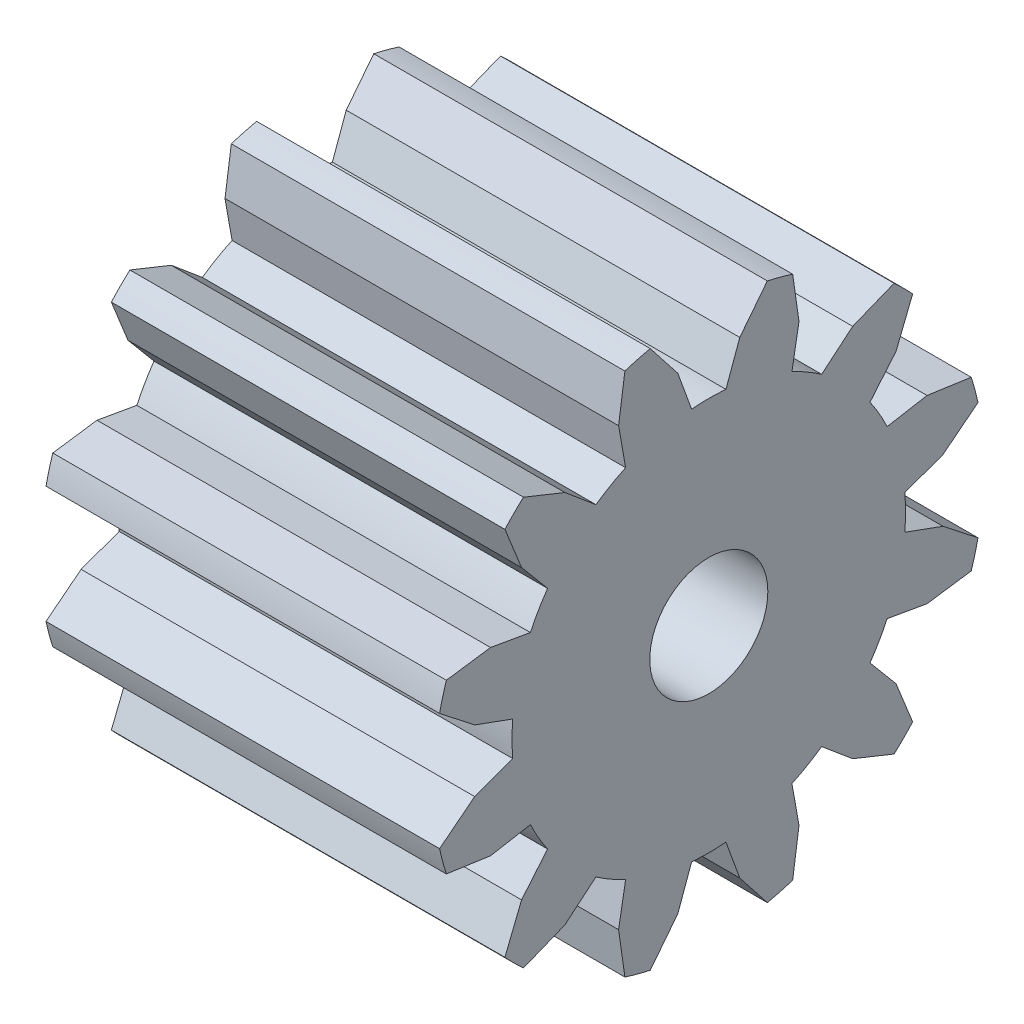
ISO-10303-21;
HEADER;
FILE_DESCRIPTION(('STEP AP214'),'2;1');
FILE_NAME('part.step','',(''),(''),'','','');
FILE_SCHEMA(('AUTOMOTIVE_DESIGN { 1 0 10303 214 1 1 1 1 }'));
ENDSEC;
DATA;
#1=APPLICATION_CONTEXT('core data for automotive mechanical design processes');
#2=APPLICATION_PROTOCOL_DEFINITION('international standard','automotive_design',2000,#1);
#3=PRODUCT_CONTEXT('',#1,'mechanical');
#4=PRODUCT('Part','Part','',(#3));
#5=PRODUCT_RELATED_PRODUCT_CATEGORY('part','',(#4));
#6=PRODUCT_DEFINITION_FORMATION('','',#4);
#7=PRODUCT_DEFINITION_CONTEXT('part definition',#1,'design');
#8=PRODUCT_DEFINITION('design','',#6,#7);
#9=PRODUCT_DEFINITION_SHAPE('','',#8);
#10=(LENGTH_UNIT() NAMED_UNIT(*) SI_UNIT(.MILLI.,.METRE.));
#11=(NAMED_UNIT(*) PLANE_ANGLE_UNIT() SI_UNIT($,.RADIAN.));
#12=(NAMED_UNIT(*) SI_UNIT($,.STERADIAN.) SOLID_ANGLE_UNIT());
#13=UNCERTAINTY_MEASURE_WITH_UNIT(LENGTH_MEASURE(1.E-05),#10,'distance_accuracy_value','');
#14=(GEOMETRIC_REPRESENTATION_CONTEXT(3) GLOBAL_UNCERTAINTY_ASSIGNED_CONTEXT((#13)) GLOBAL_UNIT_ASSIGNED_CONTEXT((#10,
#11,#12)) REPRESENTATION_CONTEXT('',''));
#15=CARTESIAN_POINT('',(0.,0.,0.));
#16=DIRECTION('',(0.,0.,1.));
#17=DIRECTION('',(1.,0.,0.));
#18=AXIS2_PLACEMENT_3D('',#15,#16,#17);
#19=CARTESIAN_POINT('',(230.,0.,0.));
#20=DIRECTION('',(-1.,0.,0.));
#21=DIRECTION('',(0.,0.,1.));
#22=AXIS2_PLACEMENT_3D('',#19,#20,#21);
#23=CYLINDRICAL_SURFACE('',#22,15.);
#24=CARTESIAN_POINT('',(-50.,0.,0.));
#25=DIRECTION('',(1.,0.,0.));
#26=DIRECTION('',(0.,1.,0.));
#27=AXIS2_PLACEMENT_3D('',#24,#25,#26);
#28=CIRCLE('',#27,15.);
#29=CARTESIAN_POINT('',(-50.,15.,0.));
#30=VERTEX_POINT('',#29);
#31=EDGE_CURVE('E11',#30,#30,#28,.T.);
#32=ORIENTED_EDGE('',*,*,#31,.F.);
#33=EDGE_LOOP('',(#32));
#34=FACE_BOUND('',#33,.T.);
#35=CARTESIAN_POINT('',(50.,0.,0.));
#36=DIRECTION('',(1.,0.,0.));
#37=DIRECTION('',(0.,0.,-1.));
#38=AXIS2_PLACEMENT_3D('',#35,#36,#37);
#39=CIRCLE('',#38,15.);
#40=CARTESIAN_POINT('',(50.,0.,-15.));
#41=VERTEX_POINT('',#40);
#42=EDGE_CURVE('E519',#41,#41,#39,.T.);
#43=ORIENTED_EDGE('',*,*,#42,.T.);
#44=EDGE_LOOP('',(#43));
#45=FACE_BOUND('',#44,.T.);
#46=ADVANCED_FACE('F49',(#34,#45),#23,.F.);
#47=CARTESIAN_POINT('',(50.,1.66984481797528E-11,9.16489106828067E-11));
#48=DIRECTION('',(-1.,0.,0.));
#49=DIRECTION('',(0.,0.,1.));
#50=AXIS2_PLACEMENT_3D('',#47,#48,#49);
#51=CYLINDRICAL_SURFACE('',#50,69.9999999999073);
#52=CARTESIAN_POINT('',(-50.,1.66984481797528E-11,9.16489106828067E-11));
#53=DIRECTION('',(1.,0.,0.));
#54=DIRECTION('',(0.,0.304521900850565,0.95250533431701));
#55=AXIS2_PLACEMENT_3D('',#52,#53,#54);
#56=CIRCLE('',#55,69.9999999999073);
#57=CARTESIAN_POINT('',(-50.,21.316533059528,66.675373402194));
#58=VERTEX_POINT('',#57);
#59=CARTESIAN_POINT('',(-50.,14.877027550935,68.400833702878));
#60=VERTEX_POINT('',#59);
#61=EDGE_CURVE('E502',#58,#60,#56,.T.);
#62=ORIENTED_EDGE('',*,*,#61,.T.);
#63=DIRECTION('',(-1.,0.,0.));
#64=VECTOR('',#63,1.);
#65=CARTESIAN_POINT('',(50.,14.877027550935,68.400833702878));
#66=LINE('',#65,#64);
#67=CARTESIAN_POINT('',(50.,14.877027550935,68.400833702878));
#68=VERTEX_POINT('',#67);
#69=EDGE_CURVE('E517',#68,#60,#66,.T.);
#70=ORIENTED_EDGE('',*,*,#69,.F.);
#71=CARTESIAN_POINT('',(50.,1.66984481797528E-11,9.16489106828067E-11));
#72=DIRECTION('',(1.,0.,0.));
#73=DIRECTION('',(0.,0.304521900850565,0.95250533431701));
#74=AXIS2_PLACEMENT_3D('',#71,#72,#73);
#75=CIRCLE('',#74,69.9999999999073);
#76=CARTESIAN_POINT('',(50.,21.316533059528,66.675373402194));
#77=VERTEX_POINT('',#76);
#78=EDGE_CURVE('E524',#77,#68,#75,.T.);
#79=ORIENTED_EDGE('',*,*,#78,.F.);
#80=DIRECTION('',(-1.,0.,0.));
#81=VECTOR('',#80,1.);
#82=CARTESIAN_POINT('',(50.,21.316533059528,66.675373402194));
#83=LINE('',#82,#81);
#84=EDGE_CURVE('E510',#77,#58,#83,.T.);
#85=ORIENTED_EDGE('',*,*,#84,.T.);
#86=EDGE_LOOP('',(#62,#70,#79,#85));
#87=FACE_BOUND('',#86,.T.);
#88=ADVANCED_FACE('F515',(#87),#51,.T.);
#89=CARTESIAN_POINT('',(50.,14.877027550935,68.400833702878));
#90=DIRECTION('',(0.,0.78672182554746,-0.617307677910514));
#91=DIRECTION('',(0.,0.617307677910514,0.78672182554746));
#92=AXIS2_PLACEMENT_3D('',#89,#90,#91);
#93=PLANE('',#92);
#94=DIRECTION('',(0.,-0.617307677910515,-0.78672182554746));
#95=VECTOR('',#94,1.);
#96=CARTESIAN_POINT('',(-50.,14.877027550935,68.400833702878));
#97=LINE('',#96,#95);
#98=CARTESIAN_POINT('',(-50.,7.8776946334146,59.480601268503));
#99=VERTEX_POINT('',#98);
#100=EDGE_CURVE('E499',#60,#99,#97,.T.);
#101=ORIENTED_EDGE('',*,*,#100,.T.);
#102=DIRECTION('',(-1.,0.,0.));
#103=VECTOR('',#102,1.);
#104=CARTESIAN_POINT('',(50.,7.8776946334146,59.480601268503));
#105=LINE('',#104,#103);
#106=CARTESIAN_POINT('',(50.,7.8776946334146,59.480601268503));
#107=VERTEX_POINT('',#106);
#108=EDGE_CURVE('E509',#107,#99,#105,.T.);
#109=ORIENTED_EDGE('',*,*,#108,.F.);
#110=DIRECTION('',(0.,-0.617307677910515,-0.78672182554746));
#111=VECTOR('',#110,1.);
#112=CARTESIAN_POINT('',(50.,14.877027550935,68.400833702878));
#113=LINE('',#112,#111);
#114=EDGE_CURVE('E523',#68,#107,#113,.T.);
#115=ORIENTED_EDGE('',*,*,#114,.F.);
#116=ORIENTED_EDGE('',*,*,#69,.T.);
#117=EDGE_LOOP('',(#101,#109,#115,#116));
#118=FACE_BOUND('',#117,.T.);
#119=ADVANCED_FACE('F522',(#118),#93,.F.);
#120=CARTESIAN_POINT('',(50.,7.8776946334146,59.480601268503));
#121=DIRECTION('',(0.,0.939692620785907,-0.342020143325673));
#122=DIRECTION('',(0.,0.342020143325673,0.939692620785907));
#123=AXIS2_PLACEMENT_3D('',#120,#121,#122);
#124=PLANE('',#123);
#125=DIRECTION('',(0.,-0.342020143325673,-0.939692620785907));
#126=VECTOR('',#125,1.);
#127=CARTESIAN_POINT('',(-50.,7.8776946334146,59.480601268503));
#128=LINE('',#127,#126);
#129=CARTESIAN_POINT('',(-50.,4.3577871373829,49.809734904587));
#130=VERTEX_POINT('',#129);
#131=EDGE_CURVE('E504',#99,#130,#128,.T.);
#132=ORIENTED_EDGE('',*,*,#131,.T.);
#133=DIRECTION('',(-1.,0.,0.));
#134=VECTOR('',#133,1.);
#135=CARTESIAN_POINT('',(50.,4.3577871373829,49.809734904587));
#136=LINE('',#135,#134);
#137=CARTESIAN_POINT('',(50.,4.3577871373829,49.809734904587));
#138=VERTEX_POINT('',#137);
#139=EDGE_CURVE('E546',#138,#130,#136,.T.);
#140=ORIENTED_EDGE('',*,*,#139,.F.);
#141=DIRECTION('',(0.,-0.342020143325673,-0.939692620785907));
#142=VECTOR('',#141,1.);
#143=CARTESIAN_POINT('',(50.,7.8776946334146,59.480601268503));
#144=LINE('',#143,#142);
#145=EDGE_CURVE('E551',#107,#138,#144,.T.);
#146=ORIENTED_EDGE('',*,*,#145,.F.);
#147=ORIENTED_EDGE('',*,*,#108,.T.);
#148=EDGE_LOOP('',(#132,#140,#146,#147));
#149=FACE_BOUND('',#148,.T.);
#150=ADVANCED_FACE('F1798',(#149),#124,.F.);
#151=CARTESIAN_POINT('',(50.,0.,7.23449078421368E-11));
#152=DIRECTION('',(-1.,0.,0.));
#153=DIRECTION('',(0.,0.,1.));
#154=AXIS2_PLACEMENT_3D('',#151,#152,#153);
#155=CYLINDRICAL_SURFACE('',#154,49.9999999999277);
#156=CARTESIAN_POINT('',(-50.,0.,7.23449078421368E-11));
#157=DIRECTION('',(1.,0.,0.));
#158=DIRECTION('',(0.,0.0871557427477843,0.996194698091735));
#159=AXIS2_PLACEMENT_3D('',#156,#157,#158);
#160=CIRCLE('',#159,49.9999999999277);
#161=CARTESIAN_POINT('',(-50.,-4.3577871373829,49.809734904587));
#162=VERTEX_POINT('',#161);
#163=EDGE_CURVE('E555',#130,#162,#160,.T.);
#164=ORIENTED_EDGE('',*,*,#163,.T.);
#165=DIRECTION('',(-1.,0.,0.));
#166=VECTOR('',#165,1.);
#167=CARTESIAN_POINT('',(50.,-4.3577871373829,49.809734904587));
#168=LINE('',#167,#166);
#169=CARTESIAN_POINT('',(50.,-4.3577871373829,49.809734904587));
#170=VERTEX_POINT('',#169);
#171=EDGE_CURVE('E560',#170,#162,#168,.T.);
#172=ORIENTED_EDGE('',*,*,#171,.F.);
#173=CARTESIAN_POINT('',(50.,0.,7.23449078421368E-11));
#174=DIRECTION('',(1.,0.,0.));
#175=DIRECTION('',(0.,0.0871557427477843,0.996194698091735));
#176=AXIS2_PLACEMENT_3D('',#173,#174,#175);
#177=CIRCLE('',#176,49.9999999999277);
#178=EDGE_CURVE('E565',#138,#170,#177,.T.);
#179=ORIENTED_EDGE('',*,*,#178,.F.);
#180=ORIENTED_EDGE('',*,*,#139,.T.);
#181=EDGE_LOOP('',(#164,#172,#179,#180));
#182=FACE_BOUND('',#181,.T.);
#183=ADVANCED_FACE('F1793',(#182),#155,.T.);
#184=CARTESIAN_POINT('',(50.,-4.3577871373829,49.809734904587));
#185=DIRECTION('',(0.,-0.93969262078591,-0.342020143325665));
#186=DIRECTION('',(0.,0.342020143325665,-0.93969262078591));
#187=AXIS2_PLACEMENT_3D('',#184,#185,#186);
#188=PLANE('',#187);
#189=DIRECTION('',(0.,-0.342020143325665,0.93969262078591));
#190=VECTOR('',#189,1.);
#191=CARTESIAN_POINT('',(-50.,-4.3577871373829,49.809734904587));
#192=LINE('',#191,#190);
#193=CARTESIAN_POINT('',(-50.,-7.8776946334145,59.480601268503));
#194=VERTEX_POINT('',#193);
#195=EDGE_CURVE('E569',#162,#194,#192,.T.);
#196=ORIENTED_EDGE('',*,*,#195,.T.);
#197=DIRECTION('',(-1.,0.,0.));
#198=VECTOR('',#197,1.);
#199=CARTESIAN_POINT('',(50.,-7.8776946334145,59.480601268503));
#200=LINE('',#199,#198);
#201=CARTESIAN_POINT('',(50.,-7.8776946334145,59.480601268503));
#202=VERTEX_POINT('',#201);
#203=EDGE_CURVE('E574',#202,#194,#200,.T.);
#204=ORIENTED_EDGE('',*,*,#203,.F.);
#205=DIRECTION('',(0.,-0.342020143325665,0.93969262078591));
#206=VECTOR('',#205,1.);
#207=CARTESIAN_POINT('',(50.,-4.3577871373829,49.809734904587));
#208=LINE('',#207,#206);
#209=EDGE_CURVE('E580',#170,#202,#208,.T.);
#210=ORIENTED_EDGE('',*,*,#209,.F.);
#211=ORIENTED_EDGE('',*,*,#171,.T.);
#212=EDGE_LOOP('',(#196,#204,#210,#211));
#213=FACE_BOUND('',#212,.T.);
#214=ADVANCED_FACE('F1790',(#213),#188,.F.);
#215=CARTESIAN_POINT('',(50.,-7.8776946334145,59.480601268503));
#216=DIRECTION('',(0.,-0.786721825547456,-0.61730767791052));
#217=DIRECTION('',(0.,0.61730767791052,-0.786721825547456));
#218=AXIS2_PLACEMENT_3D('',#215,#216,#217);
#219=PLANE('',#218);
#220=DIRECTION('',(0.,-0.61730767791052,0.786721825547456));
#221=VECTOR('',#220,1.);
#222=CARTESIAN_POINT('',(-50.,-7.8776946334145,59.480601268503));
#223=LINE('',#222,#221);
#224=CARTESIAN_POINT('',(-50.,-14.877027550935,68.400833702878));
#225=VERTEX_POINT('',#224);
#226=EDGE_CURVE('E585',#194,#225,#223,.T.);
#227=ORIENTED_EDGE('',*,*,#226,.T.);
#228=DIRECTION('',(-1.,0.,0.));
#229=VECTOR('',#228,1.);
#230=CARTESIAN_POINT('',(50.,-14.877027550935,68.400833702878));
#231=LINE('',#230,#229);
#232=CARTESIAN_POINT('',(50.,-14.877027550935,68.400833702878));
#233=VERTEX_POINT('',#232);
#234=EDGE_CURVE('E590',#233,#225,#231,.T.);
#235=ORIENTED_EDGE('',*,*,#234,.F.);
#236=DIRECTION('',(0.,-0.61730767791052,0.786721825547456));
#237=VECTOR('',#236,1.);
#238=CARTESIAN_POINT('',(50.,-7.8776946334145,59.480601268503));
#239=LINE('',#238,#237);
#240=EDGE_CURVE('E596',#202,#233,#239,.T.);
#241=ORIENTED_EDGE('',*,*,#240,.F.);
#242=ORIENTED_EDGE('',*,*,#203,.T.);
#243=EDGE_LOOP('',(#227,#235,#241,#242));
#244=FACE_BOUND('',#243,.T.);
#245=ADVANCED_FACE('F1785',(#244),#219,.F.);
#246=CARTESIAN_POINT('',(50.,-1.67019176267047E-11,9.16627884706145E-11));
#247=DIRECTION('',(-1.,0.,0.));
#248=DIRECTION('',(0.,0.,1.));
#249=AXIS2_PLACEMENT_3D('',#246,#247,#248);
#250=CYLINDRICAL_SURFACE('',#249,69.9999999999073);
#251=CARTESIAN_POINT('',(-50.,-1.67019176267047E-11,9.16627884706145E-11));
#252=DIRECTION('',(1.,0.,0.));
#253=DIRECTION('',(0.,-0.2125289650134,0.977154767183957));
#254=AXIS2_PLACEMENT_3D('',#251,#252,#253);
#255=CIRCLE('',#254,69.9999999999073);
#256=CARTESIAN_POINT('',(-50.,-21.316533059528,66.675373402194));
#257=VERTEX_POINT('',#256);
#258=EDGE_CURVE('E601',#225,#257,#255,.T.);
#259=ORIENTED_EDGE('',*,*,#258,.T.);
#260=DIRECTION('',(-1.,0.,0.));
#261=VECTOR('',#260,1.);
#262=CARTESIAN_POINT('',(50.,-21.316533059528,66.675373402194));
#263=LINE('',#262,#261);
#264=CARTESIAN_POINT('',(50.,-21.316533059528,66.675373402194));
#265=VERTEX_POINT('',#264);
#266=EDGE_CURVE('E606',#265,#257,#263,.T.);
#267=ORIENTED_EDGE('',*,*,#266,.F.);
#268=CARTESIAN_POINT('',(50.,-1.67019176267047E-11,9.16627884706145E-11));
#269=DIRECTION('',(1.,0.,0.));
#270=DIRECTION('',(0.,-0.2125289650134,0.977154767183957));
#271=AXIS2_PLACEMENT_3D('',#268,#269,#270);
#272=CIRCLE('',#271,69.9999999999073);
#273=EDGE_CURVE('E612',#233,#265,#272,.T.);
#274=ORIENTED_EDGE('',*,*,#273,.F.);
#275=ORIENTED_EDGE('',*,*,#234,.T.);
#276=EDGE_LOOP('',(#259,#267,#274,#275));
#277=FACE_BOUND('',#276,.T.);
#278=ADVANCED_FACE('F1782',(#277),#250,.T.);
#279=CARTESIAN_POINT('',(50.,-21.316533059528,66.675373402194));
#280=DIRECTION('',(0.,0.989974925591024,-0.141243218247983));
#281=DIRECTION('',(0.,0.141243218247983,0.989974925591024));
#282=AXIS2_PLACEMENT_3D('',#279,#280,#281);
#283=PLANE('',#282);
#284=DIRECTION('',(0.,-0.141243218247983,-0.989974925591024));
#285=VECTOR('',#284,1.);
#286=CARTESIAN_POINT('',(-50.,-21.316533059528,66.675373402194));
#287=LINE('',#286,#285);
#288=CARTESIAN_POINT('',(-50.,-22.918016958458,55.450559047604));
#289=VERTEX_POINT('',#288);
#290=EDGE_CURVE('E617',#257,#289,#287,.T.);
#291=ORIENTED_EDGE('',*,*,#290,.T.);
#292=DIRECTION('',(-1.,0.,0.));
#293=VECTOR('',#292,1.);
#294=CARTESIAN_POINT('',(50.,-22.918016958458,55.450559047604));
#295=LINE('',#294,#293);
#296=CARTESIAN_POINT('',(50.,-22.918016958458,55.450559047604));
#297=VERTEX_POINT('',#296);
#298=EDGE_CURVE('E622',#297,#289,#295,.T.);
#299=ORIENTED_EDGE('',*,*,#298,.F.);
#300=DIRECTION('',(0.,-0.141243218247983,-0.989974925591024));
#301=VECTOR('',#300,1.);
#302=CARTESIAN_POINT('',(50.,-21.316533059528,66.675373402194));
#303=LINE('',#302,#301);
#304=EDGE_CURVE('E628',#265,#297,#303,.T.);
#305=ORIENTED_EDGE('',*,*,#304,.F.);
#306=ORIENTED_EDGE('',*,*,#266,.T.);
#307=EDGE_LOOP('',(#291,#299,#305,#306));
#308=FACE_BOUND('',#307,.T.);
#309=ADVANCED_FACE('F1777',(#308),#283,.F.);
#310=CARTESIAN_POINT('',(50.,-22.918016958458,55.450559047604));
#311=DIRECTION('',(0.,0.984807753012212,0.173648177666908));
#312=DIRECTION('',(0.,-0.173648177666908,0.984807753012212));
#313=AXIS2_PLACEMENT_3D('',#310,#311,#312);
#314=PLANE('',#313);
#315=DIRECTION('',(0.,0.173648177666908,-0.984807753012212));
#316=VECTOR('',#315,1.);
#317=CARTESIAN_POINT('',(-50.,-22.918016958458,55.450559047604));
#318=LINE('',#317,#316);
#319=CARTESIAN_POINT('',(-50.,-21.130913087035,45.315389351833));
#320=VERTEX_POINT('',#319);
#321=EDGE_CURVE('E633',#289,#320,#318,.T.);
#322=ORIENTED_EDGE('',*,*,#321,.T.);
#323=DIRECTION('',(-1.,0.,0.));
#324=VECTOR('',#323,1.);
#325=CARTESIAN_POINT('',(50.,-21.130913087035,45.315389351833));
#326=LINE('',#325,#324);
#327=CARTESIAN_POINT('',(50.,-21.130913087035,45.315389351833));
#328=VERTEX_POINT('',#327);
#329=EDGE_CURVE('E638',#328,#320,#326,.T.);
#330=ORIENTED_EDGE('',*,*,#329,.F.);
#331=DIRECTION('',(0.,0.173648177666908,-0.984807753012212));
#332=VECTOR('',#331,1.);
#333=CARTESIAN_POINT('',(50.,-22.918016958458,55.450559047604));
#334=LINE('',#333,#332);
#335=EDGE_CURVE('E643',#297,#328,#334,.T.);
#336=ORIENTED_EDGE('',*,*,#335,.F.);
#337=ORIENTED_EDGE('',*,*,#298,.T.);
#338=EDGE_LOOP('',(#322,#330,#336,#337));
#339=FACE_BOUND('',#338,.T.);
#340=ADVANCED_FACE('F1774',(#339),#314,.F.);
#341=CARTESIAN_POINT('',(50.,3.46250805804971E-11,-5.65103519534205E-11));
#342=DIRECTION('',(-1.,0.,0.));
#343=DIRECTION('',(0.,0.,1.));
#344=AXIS2_PLACEMENT_3D('',#341,#342,#343);
#345=CYLINDRICAL_SURFACE('',#344,50.0000000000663);
#346=CARTESIAN_POINT('',(-50.,3.46250805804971E-11,-5.65103519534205E-11));
#347=DIRECTION('',(1.,0.,0.));
#348=DIRECTION('',(0.,-0.422618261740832,0.906307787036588));
#349=AXIS2_PLACEMENT_3D('',#346,#347,#348);
#350=CIRCLE('',#349,50.0000000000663);
#351=CARTESIAN_POINT('',(-50.,-28.678821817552,40.95760221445));
#352=VERTEX_POINT('',#351);
#353=EDGE_CURVE('E648',#320,#352,#350,.T.);
#354=ORIENTED_EDGE('',*,*,#353,.T.);
#355=DIRECTION('',(-1.,0.,0.));
#356=VECTOR('',#355,1.);
#357=CARTESIAN_POINT('',(50.,-28.678821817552,40.95760221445));
#358=LINE('',#357,#356);
#359=CARTESIAN_POINT('',(50.,-28.678821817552,40.95760221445));
#360=VERTEX_POINT('',#359);
#361=EDGE_CURVE('E653',#360,#352,#358,.T.);
#362=ORIENTED_EDGE('',*,*,#361,.F.);
#363=CARTESIAN_POINT('',(50.,3.46250805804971E-11,-5.65103519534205E-11));
#364=DIRECTION('',(1.,0.,0.));
#365=DIRECTION('',(0.,-0.422618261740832,0.906307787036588));
#366=AXIS2_PLACEMENT_3D('',#363,#364,#365);
#367=CIRCLE('',#366,50.0000000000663);
#368=EDGE_CURVE('E658',#328,#360,#367,.T.);
#369=ORIENTED_EDGE('',*,*,#368,.F.);
#370=ORIENTED_EDGE('',*,*,#329,.T.);
#371=EDGE_LOOP('',(#354,#362,#369,#370));
#372=FACE_BOUND('',#371,.T.);
#373=ADVANCED_FACE('F1769',(#372),#345,.T.);
#374=CARTESIAN_POINT('',(50.,-28.678821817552,40.95760221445));
#375=DIRECTION('',(0.,-0.642787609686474,-0.766044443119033));
#376=DIRECTION('',(0.,0.766044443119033,-0.642787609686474));
#377=AXIS2_PLACEMENT_3D('',#374,#375,#376);
#378=PLANE('',#377);
#379=DIRECTION('',(0.,-0.766044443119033,0.642787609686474));
#380=VECTOR('',#379,1.);
#381=CARTESIAN_POINT('',(-50.,-28.678821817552,40.95760221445));
#382=LINE('',#381,#380);
#383=CARTESIAN_POINT('',(-50.,-36.562584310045,47.572864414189));
#384=VERTEX_POINT('',#383);
#385=EDGE_CURVE('E662',#352,#384,#382,.T.);
#386=ORIENTED_EDGE('',*,*,#385,.T.);
#387=DIRECTION('',(-1.,0.,0.));
#388=VECTOR('',#387,1.);
#389=CARTESIAN_POINT('',(50.,-36.562584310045,47.572864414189));
#390=LINE('',#389,#388);
#391=CARTESIAN_POINT('',(50.,-36.562584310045,47.572864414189));
#392=VERTEX_POINT('',#391);
#393=EDGE_CURVE('E667',#392,#384,#390,.T.);
#394=ORIENTED_EDGE('',*,*,#393,.F.);
#395=DIRECTION('',(0.,-0.766044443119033,0.642787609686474));
#396=VECTOR('',#395,1.);
#397=CARTESIAN_POINT('',(50.,-28.678821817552,40.95760221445));
#398=LINE('',#397,#396);
#399=EDGE_CURVE('E672',#360,#392,#398,.T.);
#400=ORIENTED_EDGE('',*,*,#399,.F.);
#401=ORIENTED_EDGE('',*,*,#361,.T.);
#402=EDGE_LOOP('',(#386,#394,#400,#401));
#403=FACE_BOUND('',#402,.T.);
#404=ADVANCED_FACE('F1766',(#403),#378,.F.);
#405=CARTESIAN_POINT('',(50.,-36.562584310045,47.572864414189));
#406=DIRECTION('',(0.,-0.372667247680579,-0.927965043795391));
#407=DIRECTION('',(0.,0.927965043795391,-0.372667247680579));
#408=AXIS2_PLACEMENT_3D('',#405,#406,#407);
#409=PLANE('',#408);
#410=DIRECTION('',(0.,-0.927965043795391,0.37266724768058));
#411=VECTOR('',#410,1.);
#412=CARTESIAN_POINT('',(-50.,-36.562584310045,47.572864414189));
#413=LINE('',#412,#411);
#414=CARTESIAN_POINT('',(-50.,-47.084300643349,51.79834585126));
#415=VERTEX_POINT('',#414);
#416=EDGE_CURVE('E676',#384,#415,#413,.T.);
#417=ORIENTED_EDGE('',*,*,#416,.T.);
#418=DIRECTION('',(-1.,0.,0.));
#419=VECTOR('',#418,1.);
#420=CARTESIAN_POINT('',(50.,-47.084300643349,51.79834585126));
#421=LINE('',#420,#419);
#422=CARTESIAN_POINT('',(50.,-47.084300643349,51.79834585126));
#423=VERTEX_POINT('',#422);
#424=EDGE_CURVE('E681',#423,#415,#421,.T.);
#425=ORIENTED_EDGE('',*,*,#424,.F.);
#426=DIRECTION('',(0.,-0.927965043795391,0.37266724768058));
#427=VECTOR('',#426,1.);
#428=CARTESIAN_POINT('',(50.,-36.562584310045,47.572864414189));
#429=LINE('',#428,#427);
#430=EDGE_CURVE('E686',#392,#423,#429,.T.);
#431=ORIENTED_EDGE('',*,*,#430,.F.);
#432=ORIENTED_EDGE('',*,*,#393,.T.);
#433=EDGE_LOOP('',(#417,#425,#431,#432));
#434=FACE_BOUND('',#433,.T.);
#435=ADVANCED_FACE('F1761',(#434),#409,.F.);
#436=CARTESIAN_POINT('',(50.,3.70072028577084E-10,-3.70072028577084E-10));
#437=DIRECTION('',(-1.,0.,0.));
#438=DIRECTION('',(0.,0.,1.));
#439=AXIS2_PLACEMENT_3D('',#436,#437,#438);
#440=CYLINDRICAL_SURFACE('',#439,70.0000000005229);
#441=CARTESIAN_POINT('',(-50.,3.70072028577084E-10,-3.70072028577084E-10));
#442=DIRECTION('',(1.,0.,0.));
#443=DIRECTION('',(0.,-0.672632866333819,0.739976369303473));
#444=AXIS2_PLACEMENT_3D('',#441,#442,#443);
#445=CIRCLE('',#444,70.0000000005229);
#446=CARTESIAN_POINT('',(-50.,-51.79834585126,47.084300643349));
#447=VERTEX_POINT('',#446);
#448=EDGE_CURVE('E690',#415,#447,#445,.T.);
#449=ORIENTED_EDGE('',*,*,#448,.T.);
#450=DIRECTION('',(-1.,0.,0.));
#451=VECTOR('',#450,1.);
#452=CARTESIAN_POINT('',(50.,-51.79834585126,47.084300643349));
#453=LINE('',#452,#451);
#454=CARTESIAN_POINT('',(50.,-51.79834585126,47.084300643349));
#455=VERTEX_POINT('',#454);
#456=EDGE_CURVE('E695',#455,#447,#453,.T.);
#457=ORIENTED_EDGE('',*,*,#456,.F.);
#458=CARTESIAN_POINT('',(50.,3.70072028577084E-10,-3.70072028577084E-10));
#459=DIRECTION('',(1.,0.,0.));
#460=DIRECTION('',(0.,-0.672632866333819,0.739976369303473));
#461=AXIS2_PLACEMENT_3D('',#458,#459,#460);
#462=CIRCLE('',#461,70.0000000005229);
#463=EDGE_CURVE('E700',#423,#455,#462,.T.);
#464=ORIENTED_EDGE('',*,*,#463,.F.);
#465=ORIENTED_EDGE('',*,*,#424,.T.);
#466=EDGE_LOOP('',(#449,#457,#464,#465));
#467=FACE_BOUND('',#466,.T.);
#468=ADVANCED_FACE('F1758',(#467),#440,.T.);
#469=CARTESIAN_POINT('',(50.,-51.79834585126,47.084300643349));
#470=DIRECTION('',(0.,0.927965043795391,0.372667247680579));
#471=DIRECTION('',(0.,-0.372667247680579,0.927965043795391));
#472=AXIS2_PLACEMENT_3D('',#469,#470,#471);
#473=PLANE('',#472);
#474=DIRECTION('',(0.,0.37266724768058,-0.927965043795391));
#475=VECTOR('',#474,1.);
#476=CARTESIAN_POINT('',(-50.,-51.79834585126,47.084300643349));
#477=LINE('',#476,#475);
#478=CARTESIAN_POINT('',(-50.,-47.572864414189,36.562584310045));
#479=VERTEX_POINT('',#478);
#480=EDGE_CURVE('E704',#447,#479,#477,.T.);
#481=ORIENTED_EDGE('',*,*,#480,.T.);
#482=DIRECTION('',(-1.,0.,0.));
#483=VECTOR('',#482,1.);
#484=CARTESIAN_POINT('',(50.,-47.572864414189,36.562584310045));
#485=LINE('',#484,#483);
#486=CARTESIAN_POINT('',(50.,-47.572864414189,36.562584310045));
#487=VERTEX_POINT('',#486);
#488=EDGE_CURVE('E709',#487,#479,#485,.T.);
#489=ORIENTED_EDGE('',*,*,#488,.F.);
#490=DIRECTION('',(0.,0.37266724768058,-0.927965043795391));
#491=VECTOR('',#490,1.);
#492=CARTESIAN_POINT('',(50.,-51.79834585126,47.084300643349));
#493=LINE('',#492,#491);
#494=EDGE_CURVE('E714',#455,#487,#493,.T.);
#495=ORIENTED_EDGE('',*,*,#494,.F.);
#496=ORIENTED_EDGE('',*,*,#456,.T.);
#497=EDGE_LOOP('',(#481,#489,#495,#496));
#498=FACE_BOUND('',#497,.T.);
#499=ADVANCED_FACE('F1753',(#498),#473,.F.);
#500=CARTESIAN_POINT('',(50.,-47.572864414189,36.562584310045));
#501=DIRECTION('',(0.,0.766044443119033,0.642787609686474));
#502=DIRECTION('',(0.,-0.642787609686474,0.766044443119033));
#503=AXIS2_PLACEMENT_3D('',#500,#501,#502);
#504=PLANE('',#503);
#505=DIRECTION('',(0.,0.642787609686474,-0.766044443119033));
#506=VECTOR('',#505,1.);
#507=CARTESIAN_POINT('',(-50.,-47.572864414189,36.562584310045));
#508=LINE('',#507,#506);
#509=CARTESIAN_POINT('',(-50.,-40.95760221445,28.678821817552));
#510=VERTEX_POINT('',#509);
#511=EDGE_CURVE('E718',#479,#510,#508,.T.);
#512=ORIENTED_EDGE('',*,*,#511,.T.);
#513=DIRECTION('',(-1.,0.,0.));
#514=VECTOR('',#513,1.);
#515=CARTESIAN_POINT('',(50.,-40.95760221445,28.678821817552));
#516=LINE('',#515,#514);
#517=CARTESIAN_POINT('',(50.,-40.95760221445,28.678821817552));
#518=VERTEX_POINT('',#517);
#519=EDGE_CURVE('E723',#518,#510,#516,.T.);
#520=ORIENTED_EDGE('',*,*,#519,.F.);
#521=DIRECTION('',(0.,0.642787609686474,-0.766044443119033));
#522=VECTOR('',#521,1.);
#523=CARTESIAN_POINT('',(50.,-47.572864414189,36.562584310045));
#524=LINE('',#523,#522);
#525=EDGE_CURVE('E728',#487,#518,#524,.T.);
#526=ORIENTED_EDGE('',*,*,#525,.F.);
#527=ORIENTED_EDGE('',*,*,#488,.T.);
#528=EDGE_LOOP('',(#512,#520,#526,#527));
#529=FACE_BOUND('',#528,.T.);
#530=ADVANCED_FACE('F1750',(#529),#504,.F.);
#531=CARTESIAN_POINT('',(50.,-4.2861547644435E-11,2.86819179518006E-11));
#532=DIRECTION('',(-1.,0.,0.));
#533=DIRECTION('',(0.,0.,1.));
#534=AXIS2_PLACEMENT_3D('',#531,#532,#533);
#535=CYLINDRICAL_SURFACE('',#534,49.9999999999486);
#536=CARTESIAN_POINT('',(-50.,-4.2861547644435E-11,2.86819179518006E-11));
#537=DIRECTION('',(1.,0.,0.));
#538=DIRECTION('',(0.,-0.819152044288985,0.573576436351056));
#539=AXIS2_PLACEMENT_3D('',#536,#537,#538);
#540=CIRCLE('',#539,49.9999999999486);
#541=CARTESIAN_POINT('',(-50.,-45.315389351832,21.130913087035));
#542=VERTEX_POINT('',#541);
#543=EDGE_CURVE('E732',#510,#542,#540,.T.);
#544=ORIENTED_EDGE('',*,*,#543,.T.);
#545=DIRECTION('',(-1.,0.,0.));
#546=VECTOR('',#545,1.);
#547=CARTESIAN_POINT('',(50.,-45.315389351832,21.130913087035));
#548=LINE('',#547,#546);
#549=CARTESIAN_POINT('',(50.,-45.315389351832,21.130913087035));
#550=VERTEX_POINT('',#549);
#551=EDGE_CURVE('E737',#550,#542,#548,.T.);
#552=ORIENTED_EDGE('',*,*,#551,.F.);
#553=CARTESIAN_POINT('',(50.,-4.2861547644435E-11,2.86819179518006E-11));
#554=DIRECTION('',(1.,0.,0.));
#555=DIRECTION('',(0.,-0.819152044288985,0.573576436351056));
#556=AXIS2_PLACEMENT_3D('',#553,#554,#555);
#557=CIRCLE('',#556,49.9999999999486);
#558=EDGE_CURVE('E742',#518,#550,#557,.T.);
#559=ORIENTED_EDGE('',*,*,#558,.F.);
#560=ORIENTED_EDGE('',*,*,#519,.T.);
#561=EDGE_LOOP('',(#544,#552,#559,#560));
#562=FACE_BOUND('',#561,.T.);
#563=ADVANCED_FACE('F1745',(#562),#535,.T.);
#564=CARTESIAN_POINT('',(50.,-45.315389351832,21.130913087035));
#565=DIRECTION('',(0.,-0.173648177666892,-0.984807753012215));
#566=DIRECTION('',(0.,0.984807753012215,-0.173648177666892));
#567=AXIS2_PLACEMENT_3D('',#564,#565,#566);
#568=PLANE('',#567);
#569=DIRECTION('',(0.,-0.984807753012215,0.173648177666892));
#570=VECTOR('',#569,1.);
#571=CARTESIAN_POINT('',(-50.,-45.315389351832,21.130913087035));
#572=LINE('',#571,#570);
#573=CARTESIAN_POINT('',(-50.,-55.450559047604,22.918016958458));
#574=VERTEX_POINT('',#573);
#575=EDGE_CURVE('E746',#542,#574,#572,.T.);
#576=ORIENTED_EDGE('',*,*,#575,.T.);
#577=DIRECTION('',(-1.,0.,0.));
#578=VECTOR('',#577,1.);
#579=CARTESIAN_POINT('',(50.,-55.450559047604,22.918016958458));
#580=LINE('',#579,#578);
#581=CARTESIAN_POINT('',(50.,-55.450559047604,22.918016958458));
#582=VERTEX_POINT('',#581);
#583=EDGE_CURVE('E751',#582,#574,#580,.T.);
#584=ORIENTED_EDGE('',*,*,#583,.F.);
#585=DIRECTION('',(0.,-0.984807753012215,0.173648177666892));
#586=VECTOR('',#585,1.);
#587=CARTESIAN_POINT('',(50.,-45.315389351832,21.130913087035));
#588=LINE('',#587,#586);
#589=EDGE_CURVE('E756',#550,#582,#588,.T.);
#590=ORIENTED_EDGE('',*,*,#589,.F.);
#591=ORIENTED_EDGE('',*,*,#551,.T.);
#592=EDGE_LOOP('',(#576,#584,#590,#591));
#593=FACE_BOUND('',#592,.T.);
#594=ADVANCED_FACE('F1742',(#593),#568,.F.);
#595=CARTESIAN_POINT('',(50.,-55.450559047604,22.918016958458));
#596=DIRECTION('',(0.,0.141243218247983,-0.989974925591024));
#597=DIRECTION('',(0.,0.989974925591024,0.141243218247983));
#598=AXIS2_PLACEMENT_3D('',#595,#596,#597);
#599=PLANE('',#598);
#600=DIRECTION('',(0.,-0.989974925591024,-0.141243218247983));
#601=VECTOR('',#600,1.);
#602=CARTESIAN_POINT('',(-50.,-55.450559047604,22.918016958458));
#603=LINE('',#602,#601);
#604=CARTESIAN_POINT('',(-50.,-66.675373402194,21.316533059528));
#605=VERTEX_POINT('',#604);
#606=EDGE_CURVE('E760',#574,#605,#603,.T.);
#607=ORIENTED_EDGE('',*,*,#606,.T.);
#608=DIRECTION('',(-1.,0.,0.));
#609=VECTOR('',#608,1.);
#610=CARTESIAN_POINT('',(50.,-66.675373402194,21.316533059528));
#611=LINE('',#610,#609);
#612=CARTESIAN_POINT('',(50.,-66.675373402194,21.316533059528));
#613=VERTEX_POINT('',#612);
#614=EDGE_CURVE('E765',#613,#605,#611,.T.);
#615=ORIENTED_EDGE('',*,*,#614,.F.);
#616=DIRECTION('',(0.,-0.989974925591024,-0.141243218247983));
#617=VECTOR('',#616,1.);
#618=CARTESIAN_POINT('',(50.,-55.450559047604,22.918016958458));
#619=LINE('',#618,#617);
#620=EDGE_CURVE('E770',#582,#613,#619,.T.);
#621=ORIENTED_EDGE('',*,*,#620,.F.);
#622=ORIENTED_EDGE('',*,*,#583,.T.);
#623=EDGE_LOOP('',(#607,#615,#621,#622));
#624=FACE_BOUND('',#623,.T.);
#625=ADVANCED_FACE('F1737',(#624),#599,.F.);
#626=CARTESIAN_POINT('',(50.,-9.16489106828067E-11,1.66984481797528E-11));
#627=DIRECTION('',(-1.,0.,0.));
#628=DIRECTION('',(0.,0.,1.));
#629=AXIS2_PLACEMENT_3D('',#626,#627,#628);
#630=CYLINDRICAL_SURFACE('',#629,69.9999999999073);
#631=CARTESIAN_POINT('',(-50.,-9.16489106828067E-11,1.66984481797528E-11));
#632=DIRECTION('',(1.,0.,0.));
#633=DIRECTION('',(0.,-0.95250533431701,0.304521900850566));
#634=AXIS2_PLACEMENT_3D('',#631,#632,#633);
#635=CIRCLE('',#634,69.9999999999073);
#636=CARTESIAN_POINT('',(-50.,-68.400833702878,14.877027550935));
#637=VERTEX_POINT('',#636);
#638=EDGE_CURVE('E774',#605,#637,#635,.T.);
#639=ORIENTED_EDGE('',*,*,#638,.T.);
#640=DIRECTION('',(-1.,0.,0.));
#641=VECTOR('',#640,1.);
#642=CARTESIAN_POINT('',(50.,-68.400833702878,14.877027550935));
#643=LINE('',#642,#641);
#644=CARTESIAN_POINT('',(50.,-68.400833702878,14.877027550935));
#645=VERTEX_POINT('',#644);
#646=EDGE_CURVE('E779',#645,#637,#643,.T.);
#647=ORIENTED_EDGE('',*,*,#646,.F.);
#648=CARTESIAN_POINT('',(50.,-9.16489106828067E-11,1.66984481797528E-11));
#649=DIRECTION('',(1.,0.,0.));
#650=DIRECTION('',(0.,-0.95250533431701,0.304521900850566));
#651=AXIS2_PLACEMENT_3D('',#648,#649,#650);
#652=CIRCLE('',#651,69.9999999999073);
#653=EDGE_CURVE('E784',#613,#645,#652,.T.);
#654=ORIENTED_EDGE('',*,*,#653,.F.);
#655=ORIENTED_EDGE('',*,*,#614,.T.);
#656=EDGE_LOOP('',(#639,#647,#654,#655));
#657=FACE_BOUND('',#656,.T.);
#658=ADVANCED_FACE('F1734',(#657),#630,.T.);
#659=CARTESIAN_POINT('',(50.,-68.400833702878,14.877027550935));
#660=DIRECTION('',(0.,0.617307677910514,0.78672182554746));
#661=DIRECTION('',(0.,-0.78672182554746,0.617307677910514));
#662=AXIS2_PLACEMENT_3D('',#659,#660,#661);
#663=PLANE('',#662);
#664=DIRECTION('',(0.,0.786721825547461,-0.617307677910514));
#665=VECTOR('',#664,1.);
#666=CARTESIAN_POINT('',(-50.,-68.400833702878,14.877027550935));
#667=LINE('',#666,#665);
#668=CARTESIAN_POINT('',(-50.,-59.480601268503,7.8776946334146));
#669=VERTEX_POINT('',#668);
#670=EDGE_CURVE('E788',#637,#669,#667,.T.);
#671=ORIENTED_EDGE('',*,*,#670,.T.);
#672=DIRECTION('',(-1.,0.,0.));
#673=VECTOR('',#672,1.);
#674=CARTESIAN_POINT('',(50.,-59.480601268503,7.8776946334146));
#675=LINE('',#674,#673);
#676=CARTESIAN_POINT('',(50.,-59.480601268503,7.8776946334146));
#677=VERTEX_POINT('',#676);
#678=EDGE_CURVE('E793',#677,#669,#675,.T.);
#679=ORIENTED_EDGE('',*,*,#678,.F.);
#680=DIRECTION('',(0.,0.786721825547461,-0.617307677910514));
#681=VECTOR('',#680,1.);
#682=CARTESIAN_POINT('',(50.,-68.400833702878,14.877027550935));
#683=LINE('',#682,#681);
#684=EDGE_CURVE('E798',#645,#677,#683,.T.);
#685=ORIENTED_EDGE('',*,*,#684,.F.);
#686=ORIENTED_EDGE('',*,*,#646,.T.);
#687=EDGE_LOOP('',(#671,#679,#685,#686));
#688=FACE_BOUND('',#687,.T.);
#689=ADVANCED_FACE('F1729',(#688),#663,.F.);
#690=CARTESIAN_POINT('',(50.,-59.480601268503,7.8776946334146));
#691=DIRECTION('',(0.,0.342020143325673,0.939692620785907));
#692=DIRECTION('',(0.,-0.939692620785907,0.342020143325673));
#693=AXIS2_PLACEMENT_3D('',#690,#691,#692);
#694=PLANE('',#693);
#695=DIRECTION('',(0.,0.939692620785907,-0.342020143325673));
#696=VECTOR('',#695,1.);
#697=CARTESIAN_POINT('',(-50.,-59.480601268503,7.8776946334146));
#698=LINE('',#697,#696);
#699=CARTESIAN_POINT('',(-50.,-49.809734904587,4.3577871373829));
#700=VERTEX_POINT('',#699);
#701=EDGE_CURVE('E802',#669,#700,#698,.T.);
#702=ORIENTED_EDGE('',*,*,#701,.T.);
#703=DIRECTION('',(-1.,0.,0.));
#704=VECTOR('',#703,1.);
#705=CARTESIAN_POINT('',(50.,-49.809734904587,4.3577871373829));
#706=LINE('',#705,#704);
#707=CARTESIAN_POINT('',(50.,-49.809734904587,4.3577871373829));
#708=VERTEX_POINT('',#707);
#709=EDGE_CURVE('E807',#708,#700,#706,.T.);
#710=ORIENTED_EDGE('',*,*,#709,.F.);
#711=DIRECTION('',(0.,0.939692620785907,-0.342020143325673));
#712=VECTOR('',#711,1.);
#713=CARTESIAN_POINT('',(50.,-59.480601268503,7.8776946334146));
#714=LINE('',#713,#712);
#715=EDGE_CURVE('E812',#677,#708,#714,.T.);
#716=ORIENTED_EDGE('',*,*,#715,.F.);
#717=ORIENTED_EDGE('',*,*,#678,.T.);
#718=EDGE_LOOP('',(#702,#710,#716,#717));
#719=FACE_BOUND('',#718,.T.);
#720=ADVANCED_FACE('F1726',(#719),#694,.F.);
#721=CARTESIAN_POINT('',(50.,-7.23379689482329E-11,0.));
#722=DIRECTION('',(-1.,0.,0.));
#723=DIRECTION('',(0.,0.,1.));
#724=AXIS2_PLACEMENT_3D('',#721,#722,#723);
#725=CYLINDRICAL_SURFACE('',#724,49.9999999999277);
#726=CARTESIAN_POINT('',(-50.,-7.23379689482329E-11,0.));
#727=DIRECTION('',(1.,0.,0.));
#728=DIRECTION('',(0.,-0.996194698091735,0.0871557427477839));
#729=AXIS2_PLACEMENT_3D('',#726,#727,#728);
#730=CIRCLE('',#729,49.9999999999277);
#731=CARTESIAN_POINT('',(-50.,-49.809734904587,-4.35778713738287));
#732=VERTEX_POINT('',#731);
#733=EDGE_CURVE('E816',#700,#732,#730,.T.);
#734=ORIENTED_EDGE('',*,*,#733,.T.);
#735=DIRECTION('',(-1.,0.,0.));
#736=VECTOR('',#735,1.);
#737=CARTESIAN_POINT('',(50.,-49.809734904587,-4.35778713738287));
#738=LINE('',#737,#736);
#739=CARTESIAN_POINT('',(50.,-49.809734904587,-4.35778713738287));
#740=VERTEX_POINT('',#739);
#741=EDGE_CURVE('E821',#740,#732,#738,.T.);
#742=ORIENTED_EDGE('',*,*,#741,.F.);
#743=CARTESIAN_POINT('',(50.,-7.23379689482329E-11,0.));
#744=DIRECTION('',(1.,0.,0.));
#745=DIRECTION('',(0.,-0.996194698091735,0.0871557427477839));
#746=AXIS2_PLACEMENT_3D('',#743,#744,#745);
#747=CIRCLE('',#746,49.9999999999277);
#748=EDGE_CURVE('E826',#708,#740,#747,.T.);
#749=ORIENTED_EDGE('',*,*,#748,.F.);
#750=ORIENTED_EDGE('',*,*,#709,.T.);
#751=EDGE_LOOP('',(#734,#742,#749,#750));
#752=FACE_BOUND('',#751,.T.);
#753=ADVANCED_FACE('F1721',(#752),#725,.T.);
#754=CARTESIAN_POINT('',(50.,-49.809734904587,-4.3577871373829));
#755=DIRECTION('',(0.,0.342020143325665,-0.93969262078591));
#756=DIRECTION('',(0.,0.93969262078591,0.342020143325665));
#757=AXIS2_PLACEMENT_3D('',#754,#755,#756);
#758=PLANE('',#757);
#759=DIRECTION('',(0.,-0.93969262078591,-0.342020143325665));
#760=VECTOR('',#759,1.);
#761=CARTESIAN_POINT('',(-50.,-49.809734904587,-4.3577871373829));
#762=LINE('',#761,#760);
#763=CARTESIAN_POINT('',(-50.,-59.480601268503,-7.8776946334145));
#764=VERTEX_POINT('',#763);
#765=EDGE_CURVE('E830',#732,#764,#762,.T.);
#766=ORIENTED_EDGE('',*,*,#765,.T.);
#767=DIRECTION('',(-1.,0.,0.));
#768=VECTOR('',#767,1.);
#769=CARTESIAN_POINT('',(50.,-59.480601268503,-7.8776946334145));
#770=LINE('',#769,#768);
#771=CARTESIAN_POINT('',(50.,-59.480601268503,-7.8776946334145));
#772=VERTEX_POINT('',#771);
#773=EDGE_CURVE('E835',#772,#764,#770,.T.);
#774=ORIENTED_EDGE('',*,*,#773,.F.);
#775=DIRECTION('',(0.,-0.93969262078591,-0.342020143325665));
#776=VECTOR('',#775,1.);
#777=CARTESIAN_POINT('',(50.,-49.809734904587,-4.3577871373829));
#778=LINE('',#777,#776);
#779=EDGE_CURVE('E840',#740,#772,#778,.T.);
#780=ORIENTED_EDGE('',*,*,#779,.F.);
#781=ORIENTED_EDGE('',*,*,#741,.T.);
#782=EDGE_LOOP('',(#766,#774,#780,#781));
#783=FACE_BOUND('',#782,.T.);
#784=ADVANCED_FACE('F1718',(#783),#758,.F.);
#785=CARTESIAN_POINT('',(50.,-59.480601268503,-7.8776946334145));
#786=DIRECTION('',(0.,0.61730767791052,-0.786721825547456));
#787=DIRECTION('',(0.,0.786721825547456,0.61730767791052));
#788=AXIS2_PLACEMENT_3D('',#785,#786,#787);
#789=PLANE('',#788);
#790=DIRECTION('',(0.,-0.786721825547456,-0.61730767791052));
#791=VECTOR('',#790,1.);
#792=CARTESIAN_POINT('',(-50.,-59.480601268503,-7.8776946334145));
#793=LINE('',#792,#791);
#794=CARTESIAN_POINT('',(-50.,-68.400833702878,-14.877027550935));
#795=VERTEX_POINT('',#794);
#796=EDGE_CURVE('E844',#764,#795,#793,.T.);
#797=ORIENTED_EDGE('',*,*,#796,.T.);
#798=DIRECTION('',(-1.,0.,0.));
#799=VECTOR('',#798,1.);
#800=CARTESIAN_POINT('',(50.,-68.400833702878,-14.877027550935));
#801=LINE('',#800,#799);
#802=CARTESIAN_POINT('',(50.,-68.400833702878,-14.877027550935));
#803=VERTEX_POINT('',#802);
#804=EDGE_CURVE('E849',#803,#795,#801,.T.);
#805=ORIENTED_EDGE('',*,*,#804,.F.);
#806=DIRECTION('',(0.,-0.786721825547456,-0.61730767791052));
#807=VECTOR('',#806,1.);
#808=CARTESIAN_POINT('',(50.,-59.480601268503,-7.8776946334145));
#809=LINE('',#808,#807);
#810=EDGE_CURVE('E854',#772,#803,#809,.T.);
#811=ORIENTED_EDGE('',*,*,#810,.F.);
#812=ORIENTED_EDGE('',*,*,#773,.T.);
#813=EDGE_LOOP('',(#797,#805,#811,#812));
#814=FACE_BOUND('',#813,.T.);
#815=ADVANCED_FACE('F1713',(#814),#789,.F.);
#816=CARTESIAN_POINT('',(50.,-9.16627884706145E-11,-1.67019176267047E-11));
#817=DIRECTION('',(-1.,0.,0.));
#818=DIRECTION('',(0.,0.,1.));
#819=AXIS2_PLACEMENT_3D('',#816,#817,#818);
#820=CYLINDRICAL_SURFACE('',#819,69.9999999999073);
#821=CARTESIAN_POINT('',(-50.,-9.16627884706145E-11,-1.67019176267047E-11));
#822=DIRECTION('',(1.,0.,0.));
#823=DIRECTION('',(0.,-0.977154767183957,-0.2125289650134));
#824=AXIS2_PLACEMENT_3D('',#821,#822,#823);
#825=CIRCLE('',#824,69.9999999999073);
#826=CARTESIAN_POINT('',(-50.,-66.675373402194,-21.316533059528));
#827=VERTEX_POINT('',#826);
#828=EDGE_CURVE('E858',#795,#827,#825,.T.);
#829=ORIENTED_EDGE('',*,*,#828,.T.);
#830=DIRECTION('',(-1.,0.,0.));
#831=VECTOR('',#830,1.);
#832=CARTESIAN_POINT('',(50.,-66.675373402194,-21.316533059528));
#833=LINE('',#832,#831);
#834=CARTESIAN_POINT('',(50.,-66.675373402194,-21.316533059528));
#835=VERTEX_POINT('',#834);
#836=EDGE_CURVE('E863',#835,#827,#833,.T.);
#837=ORIENTED_EDGE('',*,*,#836,.F.);
#838=CARTESIAN_POINT('',(50.,-9.16627884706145E-11,-1.67019176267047E-11));
#839=DIRECTION('',(1.,0.,0.));
#840=DIRECTION('',(0.,-0.977154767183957,-0.2125289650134));
#841=AXIS2_PLACEMENT_3D('',#838,#839,#840);
#842=CIRCLE('',#841,69.9999999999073);
#843=EDGE_CURVE('E868',#803,#835,#842,.T.);
#844=ORIENTED_EDGE('',*,*,#843,.F.);
#845=ORIENTED_EDGE('',*,*,#804,.T.);
#846=EDGE_LOOP('',(#829,#837,#844,#845));
#847=FACE_BOUND('',#846,.T.);
#848=ADVANCED_FACE('F1710',(#847),#820,.T.);
#849=CARTESIAN_POINT('',(50.,-66.675373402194,-21.316533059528));
#850=DIRECTION('',(0.,0.141243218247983,0.989974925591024));
#851=DIRECTION('',(0.,-0.989974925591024,0.141243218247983));
#852=AXIS2_PLACEMENT_3D('',#849,#850,#851);
#853=PLANE('',#852);
#854=DIRECTION('',(0.,0.989974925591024,-0.141243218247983));
#855=VECTOR('',#854,1.);
#856=CARTESIAN_POINT('',(-50.,-66.675373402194,-21.316533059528));
#857=LINE('',#856,#855);
#858=CARTESIAN_POINT('',(-50.,-55.450559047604,-22.918016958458));
#859=VERTEX_POINT('',#858);
#860=EDGE_CURVE('E872',#827,#859,#857,.T.);
#861=ORIENTED_EDGE('',*,*,#860,.T.);
#862=DIRECTION('',(-1.,0.,0.));
#863=VECTOR('',#862,1.);
#864=CARTESIAN_POINT('',(50.,-55.450559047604,-22.918016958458));
#865=LINE('',#864,#863);
#866=CARTESIAN_POINT('',(50.,-55.450559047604,-22.918016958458));
#867=VERTEX_POINT('',#866);
#868=EDGE_CURVE('E877',#867,#859,#865,.T.);
#869=ORIENTED_EDGE('',*,*,#868,.F.);
#870=DIRECTION('',(0.,0.989974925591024,-0.141243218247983));
#871=VECTOR('',#870,1.);
#872=CARTESIAN_POINT('',(50.,-66.675373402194,-21.316533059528));
#873=LINE('',#872,#871);
#874=EDGE_CURVE('E882',#835,#867,#873,.T.);
#875=ORIENTED_EDGE('',*,*,#874,.F.);
#876=ORIENTED_EDGE('',*,*,#836,.T.);
#877=EDGE_LOOP('',(#861,#869,#875,#876));
#878=FACE_BOUND('',#877,.T.);
#879=ADVANCED_FACE('F1705',(#878),#853,.F.);
#880=CARTESIAN_POINT('',(50.,-55.450559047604,-22.918016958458));
#881=DIRECTION('',(0.,-0.173648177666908,0.984807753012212));
#882=DIRECTION('',(0.,-0.984807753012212,-0.173648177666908));
#883=AXIS2_PLACEMENT_3D('',#880,#881,#882);
#884=PLANE('',#883);
#885=DIRECTION('',(0.,0.984807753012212,0.173648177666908));
#886=VECTOR('',#885,1.);
#887=CARTESIAN_POINT('',(-50.,-55.450559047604,-22.918016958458));
#888=LINE('',#887,#886);
#889=CARTESIAN_POINT('',(-50.,-45.315389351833,-21.130913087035));
#890=VERTEX_POINT('',#889);
#891=EDGE_CURVE('E886',#859,#890,#888,.T.);
#892=ORIENTED_EDGE('',*,*,#891,.T.);
#893=DIRECTION('',(-1.,0.,0.));
#894=VECTOR('',#893,1.);
#895=CARTESIAN_POINT('',(50.,-45.315389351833,-21.130913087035));
#896=LINE('',#895,#894);
#897=CARTESIAN_POINT('',(50.,-45.315389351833,-21.130913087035));
#898=VERTEX_POINT('',#897);
#899=EDGE_CURVE('E891',#898,#890,#896,.T.);
#900=ORIENTED_EDGE('',*,*,#899,.F.);
#901=DIRECTION('',(0.,0.984807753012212,0.173648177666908));
#902=VECTOR('',#901,1.);
#903=CARTESIAN_POINT('',(50.,-55.450559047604,-22.918016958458));
#904=LINE('',#903,#902);
#905=EDGE_CURVE('E896',#867,#898,#904,.T.);
#906=ORIENTED_EDGE('',*,*,#905,.F.);
#907=ORIENTED_EDGE('',*,*,#868,.T.);
#908=EDGE_LOOP('',(#892,#900,#906,#907));
#909=FACE_BOUND('',#908,.T.);
#910=ADVANCED_FACE('F1702',(#909),#884,.F.);
#911=CARTESIAN_POINT('',(50.,5.65103519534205E-11,3.46250805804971E-11));
#912=DIRECTION('',(-1.,0.,0.));
#913=DIRECTION('',(0.,0.,1.));
#914=AXIS2_PLACEMENT_3D('',#911,#912,#913);
#915=CYLINDRICAL_SURFACE('',#914,50.0000000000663);
#916=CARTESIAN_POINT('',(-50.,5.65103519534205E-11,3.46250805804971E-11));
#917=DIRECTION('',(1.,0.,0.));
#918=DIRECTION('',(0.,-0.906307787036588,-0.422618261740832));
#919=AXIS2_PLACEMENT_3D('',#916,#917,#918);
#920=CIRCLE('',#919,50.0000000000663);
#921=CARTESIAN_POINT('',(-50.,-40.95760221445,-28.678821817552));
#922=VERTEX_POINT('',#921);
#923=EDGE_CURVE('E900',#890,#922,#920,.T.);
#924=ORIENTED_EDGE('',*,*,#923,.T.);
#925=DIRECTION('',(-1.,0.,0.));
#926=VECTOR('',#925,1.);
#927=CARTESIAN_POINT('',(50.,-40.95760221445,-28.678821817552));
#928=LINE('',#927,#926);
#929=CARTESIAN_POINT('',(50.,-40.95760221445,-28.678821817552));
#930=VERTEX_POINT('',#929);
#931=EDGE_CURVE('E905',#930,#922,#928,.T.);
#932=ORIENTED_EDGE('',*,*,#931,.F.);
#933=CARTESIAN_POINT('',(50.,5.65103519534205E-11,3.46250805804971E-11));
#934=DIRECTION('',(1.,0.,0.));
#935=DIRECTION('',(0.,-0.906307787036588,-0.422618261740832));
#936=AXIS2_PLACEMENT_3D('',#933,#934,#935);
#937=CIRCLE('',#936,50.0000000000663);
#938=EDGE_CURVE('E910',#898,#930,#937,.T.);
#939=ORIENTED_EDGE('',*,*,#938,.F.);
#940=ORIENTED_EDGE('',*,*,#899,.T.);
#941=EDGE_LOOP('',(#924,#932,#939,#940));
#942=FACE_BOUND('',#941,.T.);
#943=ADVANCED_FACE('F1697',(#942),#915,.T.);
#944=CARTESIAN_POINT('',(50.,-40.95760221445,-28.678821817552));
#945=DIRECTION('',(0.,0.766044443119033,-0.642787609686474));
#946=DIRECTION('',(0.,0.642787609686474,0.766044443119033));
#947=AXIS2_PLACEMENT_3D('',#944,#945,#946);
#948=PLANE('',#947);
#949=DIRECTION('',(0.,-0.642787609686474,-0.766044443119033));
#950=VECTOR('',#949,1.);
#951=CARTESIAN_POINT('',(-50.,-40.95760221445,-28.678821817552));
#952=LINE('',#951,#950);
#953=CARTESIAN_POINT('',(-50.,-47.572864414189,-36.562584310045));
#954=VERTEX_POINT('',#953);
#955=EDGE_CURVE('E914',#922,#954,#952,.T.);
#956=ORIENTED_EDGE('',*,*,#955,.T.);
#957=DIRECTION('',(-1.,0.,0.));
#958=VECTOR('',#957,1.);
#959=CARTESIAN_POINT('',(50.,-47.572864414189,-36.562584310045));
#960=LINE('',#959,#958);
#961=CARTESIAN_POINT('',(50.,-47.572864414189,-36.562584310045));
#962=VERTEX_POINT('',#961);
#963=EDGE_CURVE('E919',#962,#954,#960,.T.);
#964=ORIENTED_EDGE('',*,*,#963,.F.);
#965=DIRECTION('',(0.,-0.642787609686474,-0.766044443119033));
#966=VECTOR('',#965,1.);
#967=CARTESIAN_POINT('',(50.,-40.95760221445,-28.678821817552));
#968=LINE('',#967,#966);
#969=EDGE_CURVE('E924',#930,#962,#968,.T.);
#970=ORIENTED_EDGE('',*,*,#969,.F.);
#971=ORIENTED_EDGE('',*,*,#931,.T.);
#972=EDGE_LOOP('',(#956,#964,#970,#971));
#973=FACE_BOUND('',#972,.T.);
#974=ADVANCED_FACE('F1694',(#973),#948,.F.);
#975=CARTESIAN_POINT('',(50.,-47.572864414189,-36.562584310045));
#976=DIRECTION('',(0.,0.927965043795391,-0.372667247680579));
#977=DIRECTION('',(0.,0.372667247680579,0.927965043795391));
#978=AXIS2_PLACEMENT_3D('',#975,#976,#977);
#979=PLANE('',#978);
#980=DIRECTION('',(0.,-0.37266724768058,-0.927965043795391));
#981=VECTOR('',#980,1.);
#982=CARTESIAN_POINT('',(-50.,-47.572864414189,-36.562584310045));
#983=LINE('',#982,#981);
#984=CARTESIAN_POINT('',(-50.,-51.79834585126,-47.084300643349));
#985=VERTEX_POINT('',#984);
#986=EDGE_CURVE('E928',#954,#985,#983,.T.);
#987=ORIENTED_EDGE('',*,*,#986,.T.);
#988=DIRECTION('',(-1.,0.,0.));
#989=VECTOR('',#988,1.);
#990=CARTESIAN_POINT('',(50.,-51.79834585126,-47.084300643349));
#991=LINE('',#990,#989);
#992=CARTESIAN_POINT('',(50.,-51.79834585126,-47.084300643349));
#993=VERTEX_POINT('',#992);
#994=EDGE_CURVE('E933',#993,#985,#991,.T.);
#995=ORIENTED_EDGE('',*,*,#994,.F.);
#996=DIRECTION('',(0.,-0.37266724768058,-0.927965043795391));
#997=VECTOR('',#996,1.);
#998=CARTESIAN_POINT('',(50.,-47.572864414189,-36.562584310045));
#999=LINE('',#998,#997);
#1000=EDGE_CURVE('E938',#962,#993,#999,.T.);
#1001=ORIENTED_EDGE('',*,*,#1000,.F.);
#1002=ORIENTED_EDGE('',*,*,#963,.T.);
#1003=EDGE_LOOP('',(#987,#995,#1001,#1002));
#1004=FACE_BOUND('',#1003,.T.);
#1005=ADVANCED_FACE('F1689',(#1004),#979,.F.);
#1006=CARTESIAN_POINT('',(50.,3.70072028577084E-10,3.70072028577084E-10));
#1007=DIRECTION('',(-1.,0.,0.));
#1008=DIRECTION('',(0.,0.,1.));
#1009=AXIS2_PLACEMENT_3D('',#1006,#1007,#1008);
#1010=CYLINDRICAL_SURFACE('',#1009,70.0000000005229);
#1011=CARTESIAN_POINT('',(-50.,3.70072028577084E-10,3.70072028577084E-10));
#1012=DIRECTION('',(1.,0.,0.));
#1013=DIRECTION('',(0.,-0.739976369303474,-0.672632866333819));
#1014=AXIS2_PLACEMENT_3D('',#1011,#1012,#1013);
#1015=CIRCLE('',#1014,70.0000000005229);
#1016=CARTESIAN_POINT('',(-50.,-47.084300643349,-51.79834585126));
#1017=VERTEX_POINT('',#1016);
#1018=EDGE_CURVE('E942',#985,#1017,#1015,.T.);
#1019=ORIENTED_EDGE('',*,*,#1018,.T.);
#1020=DIRECTION('',(-1.,0.,0.));
#1021=VECTOR('',#1020,1.);
#1022=CARTESIAN_POINT('',(50.,-47.084300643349,-51.79834585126));
#1023=LINE('',#1022,#1021);
#1024=CARTESIAN_POINT('',(50.,-47.084300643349,-51.79834585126));
#1025=VERTEX_POINT('',#1024);
#1026=EDGE_CURVE('E947',#1025,#1017,#1023,.T.);
#1027=ORIENTED_EDGE('',*,*,#1026,.F.);
#1028=CARTESIAN_POINT('',(50.,3.70072028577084E-10,3.70072028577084E-10));
#1029=DIRECTION('',(1.,0.,0.));
#1030=DIRECTION('',(0.,-0.739976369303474,-0.672632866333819));
#1031=AXIS2_PLACEMENT_3D('',#1028,#1029,#1030);
#1032=CIRCLE('',#1031,70.0000000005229);
#1033=EDGE_CURVE('E952',#993,#1025,#1032,.T.);
#1034=ORIENTED_EDGE('',*,*,#1033,.F.);
#1035=ORIENTED_EDGE('',*,*,#994,.T.);
#1036=EDGE_LOOP('',(#1019,#1027,#1034,#1035));
#1037=FACE_BOUND('',#1036,.T.);
#1038=ADVANCED_FACE('F1686',(#1037),#1010,.T.);
#1039=CARTESIAN_POINT('',(50.,-47.084300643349,-51.79834585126));
#1040=DIRECTION('',(0.,-0.372667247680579,0.927965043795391));
#1041=DIRECTION('',(0.,-0.927965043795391,-0.372667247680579));
#1042=AXIS2_PLACEMENT_3D('',#1039,#1040,#1041);
#1043=PLANE('',#1042);
#1044=DIRECTION('',(0.,0.927965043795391,0.37266724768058));
#1045=VECTOR('',#1044,1.);
#1046=CARTESIAN_POINT('',(-50.,-47.084300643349,-51.79834585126));
#1047=LINE('',#1046,#1045);
#1048=CARTESIAN_POINT('',(-50.,-36.562584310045,-47.572864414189));
#1049=VERTEX_POINT('',#1048);
#1050=EDGE_CURVE('E956',#1017,#1049,#1047,.T.);
#1051=ORIENTED_EDGE('',*,*,#1050,.T.);
#1052=DIRECTION('',(-1.,0.,0.));
#1053=VECTOR('',#1052,1.);
#1054=CARTESIAN_POINT('',(50.,-36.562584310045,-47.572864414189));
#1055=LINE('',#1054,#1053);
#1056=CARTESIAN_POINT('',(50.,-36.562584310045,-47.572864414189));
#1057=VERTEX_POINT('',#1056);
#1058=EDGE_CURVE('E961',#1057,#1049,#1055,.T.);
#1059=ORIENTED_EDGE('',*,*,#1058,.F.);
#1060=DIRECTION('',(0.,0.927965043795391,0.37266724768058));
#1061=VECTOR('',#1060,1.);
#1062=CARTESIAN_POINT('',(50.,-47.084300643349,-51.79834585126));
#1063=LINE('',#1062,#1061);
#1064=EDGE_CURVE('E966',#1025,#1057,#1063,.T.);
#1065=ORIENTED_EDGE('',*,*,#1064,.F.);
#1066=ORIENTED_EDGE('',*,*,#1026,.T.);
#1067=EDGE_LOOP('',(#1051,#1059,#1065,#1066));
#1068=FACE_BOUND('',#1067,.T.);
#1069=ADVANCED_FACE('F1681',(#1068),#1043,.F.);
#1070=CARTESIAN_POINT('',(50.,-36.562584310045,-47.572864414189));
#1071=DIRECTION('',(0.,-0.642787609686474,0.766044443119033));
#1072=DIRECTION('',(0.,-0.766044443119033,-0.642787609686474));
#1073=AXIS2_PLACEMENT_3D('',#1070,#1071,#1072);
#1074=PLANE('',#1073);
#1075=DIRECTION('',(0.,0.766044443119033,0.642787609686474));
#1076=VECTOR('',#1075,1.);
#1077=CARTESIAN_POINT('',(-50.,-36.562584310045,-47.572864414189));
#1078=LINE('',#1077,#1076);
#1079=CARTESIAN_POINT('',(-50.,-28.678821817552,-40.95760221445));
#1080=VERTEX_POINT('',#1079);
#1081=EDGE_CURVE('E970',#1049,#1080,#1078,.T.);
#1082=ORIENTED_EDGE('',*,*,#1081,.T.);
#1083=DIRECTION('',(-1.,0.,0.));
#1084=VECTOR('',#1083,1.);
#1085=CARTESIAN_POINT('',(50.,-28.678821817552,-40.95760221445));
#1086=LINE('',#1085,#1084);
#1087=CARTESIAN_POINT('',(50.,-28.678821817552,-40.95760221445));
#1088=VERTEX_POINT('',#1087);
#1089=EDGE_CURVE('E975',#1088,#1080,#1086,.T.);
#1090=ORIENTED_EDGE('',*,*,#1089,.F.);
#1091=DIRECTION('',(0.,0.766044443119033,0.642787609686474));
#1092=VECTOR('',#1091,1.);
#1093=CARTESIAN_POINT('',(50.,-36.562584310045,-47.572864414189));
#1094=LINE('',#1093,#1092);
#1095=EDGE_CURVE('E980',#1057,#1088,#1094,.T.);
#1096=ORIENTED_EDGE('',*,*,#1095,.F.);
#1097=ORIENTED_EDGE('',*,*,#1058,.T.);
#1098=EDGE_LOOP('',(#1082,#1090,#1096,#1097));
#1099=FACE_BOUND('',#1098,.T.);
#1100=ADVANCED_FACE('F1678',(#1099),#1074,.F.);
#1101=CARTESIAN_POINT('',(50.,-2.86819179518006E-11,-4.2861547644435E-11));
#1102=DIRECTION('',(-1.,0.,0.));
#1103=DIRECTION('',(0.,0.,1.));
#1104=AXIS2_PLACEMENT_3D('',#1101,#1102,#1103);
#1105=CYLINDRICAL_SURFACE('',#1104,49.9999999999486);
#1106=CARTESIAN_POINT('',(-50.,-2.86819179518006E-11,-4.2861547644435E-11));
#1107=DIRECTION('',(1.,0.,0.));
#1108=DIRECTION('',(0.,-0.573576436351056,-0.819152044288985));
#1109=AXIS2_PLACEMENT_3D('',#1106,#1107,#1108);
#1110=CIRCLE('',#1109,49.9999999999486);
#1111=CARTESIAN_POINT('',(-50.,-21.130913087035,-45.315389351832));
#1112=VERTEX_POINT('',#1111);
#1113=EDGE_CURVE('E984',#1080,#1112,#1110,.T.);
#1114=ORIENTED_EDGE('',*,*,#1113,.T.);
#1115=DIRECTION('',(-1.,0.,0.));
#1116=VECTOR('',#1115,1.);
#1117=CARTESIAN_POINT('',(50.,-21.130913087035,-45.315389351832));
#1118=LINE('',#1117,#1116);
#1119=CARTESIAN_POINT('',(50.,-21.130913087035,-45.315389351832));
#1120=VERTEX_POINT('',#1119);
#1121=EDGE_CURVE('E989',#1120,#1112,#1118,.T.);
#1122=ORIENTED_EDGE('',*,*,#1121,.F.);
#1123=CARTESIAN_POINT('',(50.,-2.86819179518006E-11,-4.2861547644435E-11));
#1124=DIRECTION('',(1.,0.,0.));
#1125=DIRECTION('',(0.,-0.573576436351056,-0.819152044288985));
#1126=AXIS2_PLACEMENT_3D('',#1123,#1124,#1125);
#1127=CIRCLE('',#1126,49.9999999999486);
#1128=EDGE_CURVE('E994',#1088,#1120,#1127,.T.);
#1129=ORIENTED_EDGE('',*,*,#1128,.F.);
#1130=ORIENTED_EDGE('',*,*,#1089,.T.);
#1131=EDGE_LOOP('',(#1114,#1122,#1129,#1130));
#1132=FACE_BOUND('',#1131,.T.);
#1133=ADVANCED_FACE('F1673',(#1132),#1105,.T.);
#1134=CARTESIAN_POINT('',(50.,-21.130913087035,-45.315389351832));
#1135=DIRECTION('',(0.,0.984807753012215,-0.173648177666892));
#1136=DIRECTION('',(0.,0.173648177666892,0.984807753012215));
#1137=AXIS2_PLACEMENT_3D('',#1134,#1135,#1136);
#1138=PLANE('',#1137);
#1139=DIRECTION('',(0.,-0.173648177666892,-0.984807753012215));
#1140=VECTOR('',#1139,1.);
#1141=CARTESIAN_POINT('',(-50.,-21.130913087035,-45.315389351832));
#1142=LINE('',#1141,#1140);
#1143=CARTESIAN_POINT('',(-50.,-22.918016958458,-55.450559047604));
#1144=VERTEX_POINT('',#1143);
#1145=EDGE_CURVE('E998',#1112,#1144,#1142,.T.);
#1146=ORIENTED_EDGE('',*,*,#1145,.T.);
#1147=DIRECTION('',(-1.,0.,0.));
#1148=VECTOR('',#1147,1.);
#1149=CARTESIAN_POINT('',(50.,-22.918016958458,-55.450559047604));
#1150=LINE('',#1149,#1148);
#1151=CARTESIAN_POINT('',(50.,-22.918016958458,-55.450559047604));
#1152=VERTEX_POINT('',#1151);
#1153=EDGE_CURVE('E1003',#1152,#1144,#1150,.T.);
#1154=ORIENTED_EDGE('',*,*,#1153,.F.);
#1155=DIRECTION('',(0.,-0.173648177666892,-0.984807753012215));
#1156=VECTOR('',#1155,1.);
#1157=CARTESIAN_POINT('',(50.,-21.130913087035,-45.315389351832));
#1158=LINE('',#1157,#1156);
#1159=EDGE_CURVE('E1008',#1120,#1152,#1158,.T.);
#1160=ORIENTED_EDGE('',*,*,#1159,.F.);
#1161=ORIENTED_EDGE('',*,*,#1121,.T.);
#1162=EDGE_LOOP('',(#1146,#1154,#1160,#1161));
#1163=FACE_BOUND('',#1162,.T.);
#1164=ADVANCED_FACE('F1670',(#1163),#1138,.F.);
#1165=CARTESIAN_POINT('',(50.,-22.918016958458,-55.450559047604));
#1166=DIRECTION('',(0.,0.989974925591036,0.141243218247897));
#1167=DIRECTION('',(0.,-0.141243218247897,0.989974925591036));
#1168=AXIS2_PLACEMENT_3D('',#1165,#1166,#1167);
#1169=PLANE('',#1168);
#1170=DIRECTION('',(0.,0.141243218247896,-0.989974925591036));
#1171=VECTOR('',#1170,1.);
#1172=CARTESIAN_POINT('',(-50.,-22.918016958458,-55.450559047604));
#1173=LINE('',#1172,#1171);
#1174=CARTESIAN_POINT('',(-50.,-21.316533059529,-66.675373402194));
#1175=VERTEX_POINT('',#1174);
#1176=EDGE_CURVE('E1012',#1144,#1175,#1173,.T.);
#1177=ORIENTED_EDGE('',*,*,#1176,.T.);
#1178=DIRECTION('',(-1.,0.,0.));
#1179=VECTOR('',#1178,1.);
#1180=CARTESIAN_POINT('',(50.,-21.316533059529,-66.675373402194));
#1181=LINE('',#1180,#1179);
#1182=CARTESIAN_POINT('',(50.,-21.316533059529,-66.675373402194));
#1183=VERTEX_POINT('',#1182);
#1184=EDGE_CURVE('E1017',#1183,#1175,#1181,.T.);
#1185=ORIENTED_EDGE('',*,*,#1184,.F.);
#1186=DIRECTION('',(0.,0.141243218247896,-0.989974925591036));
#1187=VECTOR('',#1186,1.);
#1188=CARTESIAN_POINT('',(50.,-22.918016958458,-55.450559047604));
#1189=LINE('',#1188,#1187);
#1190=EDGE_CURVE('E1022',#1152,#1183,#1189,.T.);
#1191=ORIENTED_EDGE('',*,*,#1190,.F.);
#1192=ORIENTED_EDGE('',*,*,#1153,.T.);
#1193=EDGE_LOOP('',(#1177,#1185,#1191,#1192));
#1194=FACE_BOUND('',#1193,.T.);
#1195=ADVANCED_FACE('F1665',(#1194),#1169,.F.);
#1196=CARTESIAN_POINT('',(50.,1.49186218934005E-11,3.86912724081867E-11));
#1197=DIRECTION('',(-1.,0.,0.));
#1198=DIRECTION('',(0.,0.,1.));
#1199=AXIS2_PLACEMENT_3D('',#1196,#1197,#1198);
#1200=CYLINDRICAL_SURFACE('',#1199,70.0000000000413);
#1201=CARTESIAN_POINT('',(-50.,1.49186218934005E-11,3.86912724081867E-11));
#1202=DIRECTION('',(1.,0.,0.));
#1203=DIRECTION('',(0.,-0.304521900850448,-0.952505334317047));
#1204=AXIS2_PLACEMENT_3D('',#1201,#1202,#1203);
#1205=CIRCLE('',#1204,70.0000000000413);
#1206=CARTESIAN_POINT('',(-50.,-14.877027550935,-68.400833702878));
#1207=VERTEX_POINT('',#1206);
#1208=EDGE_CURVE('E1026',#1175,#1207,#1205,.T.);
#1209=ORIENTED_EDGE('',*,*,#1208,.T.);
#1210=DIRECTION('',(-1.,0.,0.));
#1211=VECTOR('',#1210,1.);
#1212=CARTESIAN_POINT('',(50.,-14.877027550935,-68.400833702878));
#1213=LINE('',#1212,#1211);
#1214=CARTESIAN_POINT('',(50.,-14.877027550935,-68.400833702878));
#1215=VERTEX_POINT('',#1214);
#1216=EDGE_CURVE('E1031',#1215,#1207,#1213,.T.);
#1217=ORIENTED_EDGE('',*,*,#1216,.F.);
#1218=CARTESIAN_POINT('',(50.,1.49186218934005E-11,3.86912724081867E-11));
#1219=DIRECTION('',(1.,0.,0.));
#1220=DIRECTION('',(0.,-0.304521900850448,-0.952505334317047));
#1221=AXIS2_PLACEMENT_3D('',#1218,#1219,#1220);
#1222=CIRCLE('',#1221,70.0000000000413);
#1223=EDGE_CURVE('E1036',#1183,#1215,#1222,.T.);
#1224=ORIENTED_EDGE('',*,*,#1223,.F.);
#1225=ORIENTED_EDGE('',*,*,#1184,.T.);
#1226=EDGE_LOOP('',(#1209,#1217,#1224,#1225));
#1227=FACE_BOUND('',#1226,.T.);
#1228=ADVANCED_FACE('F1662',(#1227),#1200,.T.);
#1229=CARTESIAN_POINT('',(50.,-14.877027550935,-68.400833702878));
#1230=DIRECTION('',(0.,-0.78672182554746,0.617307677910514));
#1231=DIRECTION('',(0.,-0.617307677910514,-0.78672182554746));
#1232=AXIS2_PLACEMENT_3D('',#1229,#1230,#1231);
#1233=PLANE('',#1232);
#1234=DIRECTION('',(0.,0.617307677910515,0.78672182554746));
#1235=VECTOR('',#1234,1.);
#1236=CARTESIAN_POINT('',(-50.,-14.877027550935,-68.400833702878));
#1237=LINE('',#1236,#1235);
#1238=CARTESIAN_POINT('',(-50.,-7.8776946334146,-59.480601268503));
#1239=VERTEX_POINT('',#1238);
#1240=EDGE_CURVE('E1040',#1207,#1239,#1237,.T.);
#1241=ORIENTED_EDGE('',*,*,#1240,.T.);
#1242=DIRECTION('',(-1.,0.,0.));
#1243=VECTOR('',#1242,1.);
#1244=CARTESIAN_POINT('',(50.,-7.8776946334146,-59.480601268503));
#1245=LINE('',#1244,#1243);
#1246=CARTESIAN_POINT('',(50.,-7.8776946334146,-59.480601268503));
#1247=VERTEX_POINT('',#1246);
#1248=EDGE_CURVE('E1045',#1247,#1239,#1245,.T.);
#1249=ORIENTED_EDGE('',*,*,#1248,.F.);
#1250=DIRECTION('',(0.,0.617307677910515,0.78672182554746));
#1251=VECTOR('',#1250,1.);
#1252=CARTESIAN_POINT('',(50.,-14.877027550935,-68.400833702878));
#1253=LINE('',#1252,#1251);
#1254=EDGE_CURVE('E1050',#1215,#1247,#1253,.T.);
#1255=ORIENTED_EDGE('',*,*,#1254,.F.);
#1256=ORIENTED_EDGE('',*,*,#1216,.T.);
#1257=EDGE_LOOP('',(#1241,#1249,#1255,#1256));
#1258=FACE_BOUND('',#1257,.T.);
#1259=ADVANCED_FACE('F1657',(#1258),#1233,.F.);
#1260=CARTESIAN_POINT('',(50.,-7.8776946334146,-59.480601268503));
#1261=DIRECTION('',(0.,-0.93969262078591,0.342020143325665));
#1262=DIRECTION('',(0.,-0.342020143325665,-0.93969262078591));
#1263=AXIS2_PLACEMENT_3D('',#1260,#1261,#1262);
#1264=PLANE('',#1263);
#1265=DIRECTION('',(0.,0.342020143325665,0.93969262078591));
#1266=VECTOR('',#1265,1.);
#1267=CARTESIAN_POINT('',(-50.,-7.8776946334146,-59.480601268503));
#1268=LINE('',#1267,#1266);
#1269=CARTESIAN_POINT('',(-50.,-4.357787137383,-49.809734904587));
#1270=VERTEX_POINT('',#1269);
#1271=EDGE_CURVE('E1054',#1239,#1270,#1268,.T.);
#1272=ORIENTED_EDGE('',*,*,#1271,.T.);
#1273=DIRECTION('',(-1.,0.,0.));
#1274=VECTOR('',#1273,1.);
#1275=CARTESIAN_POINT('',(50.,-4.357787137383,-49.809734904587));
#1276=LINE('',#1275,#1274);
#1277=CARTESIAN_POINT('',(50.,-4.357787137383,-49.809734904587));
#1278=VERTEX_POINT('',#1277);
#1279=EDGE_CURVE('E1059',#1278,#1270,#1276,.T.);
#1280=ORIENTED_EDGE('',*,*,#1279,.F.);
#1281=DIRECTION('',(0.,0.342020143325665,0.93969262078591));
#1282=VECTOR('',#1281,1.);
#1283=CARTESIAN_POINT('',(50.,-7.8776946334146,-59.480601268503));
#1284=LINE('',#1283,#1282);
#1285=EDGE_CURVE('E1064',#1247,#1278,#1284,.T.);
#1286=ORIENTED_EDGE('',*,*,#1285,.F.);
#1287=ORIENTED_EDGE('',*,*,#1248,.T.);
#1288=EDGE_LOOP('',(#1272,#1280,#1286,#1287));
#1289=FACE_BOUND('',#1288,.T.);
#1290=ADVANCED_FACE('F1654',(#1289),#1264,.F.);
#1291=CARTESIAN_POINT('',(50.,0.,-7.11652958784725E-11));
#1292=DIRECTION('',(-1.,0.,0.));
#1293=DIRECTION('',(0.,0.,1.));
#1294=AXIS2_PLACEMENT_3D('',#1291,#1292,#1293);
#1295=CYLINDRICAL_SURFACE('',#1294,49.9999999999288);
#1296=CARTESIAN_POINT('',(-50.,0.,-7.11652958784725E-11));
#1297=DIRECTION('',(1.,0.,0.));
#1298=DIRECTION('',(0.,-0.0871557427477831,-0.996194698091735));
#1299=AXIS2_PLACEMENT_3D('',#1296,#1297,#1298);
#1300=CIRCLE('',#1299,49.9999999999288);
#1301=CARTESIAN_POINT('',(-50.,4.35778713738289,-49.809734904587));
#1302=VERTEX_POINT('',#1301);
#1303=EDGE_CURVE('E1068',#1270,#1302,#1300,.T.);
#1304=ORIENTED_EDGE('',*,*,#1303,.T.);
#1305=DIRECTION('',(-1.,0.,0.));
#1306=VECTOR('',#1305,1.);
#1307=CARTESIAN_POINT('',(50.,4.35778713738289,-49.809734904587));
#1308=LINE('',#1307,#1306);
#1309=CARTESIAN_POINT('',(50.,4.35778713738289,-49.809734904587));
#1310=VERTEX_POINT('',#1309);
#1311=EDGE_CURVE('E1073',#1310,#1302,#1308,.T.);
#1312=ORIENTED_EDGE('',*,*,#1311,.F.);
#1313=CARTESIAN_POINT('',(50.,0.,-7.11652958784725E-11));
#1314=DIRECTION('',(1.,0.,0.));
#1315=DIRECTION('',(0.,-0.0871557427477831,-0.996194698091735));
#1316=AXIS2_PLACEMENT_3D('',#1313,#1314,#1315);
#1317=CIRCLE('',#1316,49.9999999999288);
#1318=EDGE_CURVE('E1078',#1278,#1310,#1317,.T.);
#1319=ORIENTED_EDGE('',*,*,#1318,.F.);
#1320=ORIENTED_EDGE('',*,*,#1279,.T.);
#1321=EDGE_LOOP('',(#1304,#1312,#1319,#1320));
#1322=FACE_BOUND('',#1321,.T.);
#1323=ADVANCED_FACE('F1649',(#1322),#1295,.T.);
#1324=CARTESIAN_POINT('',(50.,4.3577871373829,-49.809734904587));
#1325=DIRECTION('',(0.,0.93969262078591,0.342020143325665));
#1326=DIRECTION('',(0.,-0.342020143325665,0.93969262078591));
#1327=AXIS2_PLACEMENT_3D('',#1324,#1325,#1326);
#1328=PLANE('',#1327);
#1329=DIRECTION('',(0.,0.342020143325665,-0.93969262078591));
#1330=VECTOR('',#1329,1.);
#1331=CARTESIAN_POINT('',(-50.,4.3577871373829,-49.809734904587));
#1332=LINE('',#1331,#1330);
#1333=CARTESIAN_POINT('',(-50.,7.8776946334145,-59.480601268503));
#1334=VERTEX_POINT('',#1333);
#1335=EDGE_CURVE('E1082',#1302,#1334,#1332,.T.);
#1336=ORIENTED_EDGE('',*,*,#1335,.T.);
#1337=DIRECTION('',(-1.,0.,0.));
#1338=VECTOR('',#1337,1.);
#1339=CARTESIAN_POINT('',(50.,7.8776946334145,-59.480601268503));
#1340=LINE('',#1339,#1338);
#1341=CARTESIAN_POINT('',(50.,7.8776946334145,-59.480601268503));
#1342=VERTEX_POINT('',#1341);
#1343=EDGE_CURVE('E1087',#1342,#1334,#1340,.T.);
#1344=ORIENTED_EDGE('',*,*,#1343,.F.);
#1345=DIRECTION('',(0.,0.342020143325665,-0.93969262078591));
#1346=VECTOR('',#1345,1.);
#1347=CARTESIAN_POINT('',(50.,4.3577871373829,-49.809734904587));
#1348=LINE('',#1347,#1346);
#1349=EDGE_CURVE('E1092',#1310,#1342,#1348,.T.);
#1350=ORIENTED_EDGE('',*,*,#1349,.F.);
#1351=ORIENTED_EDGE('',*,*,#1311,.T.);
#1352=EDGE_LOOP('',(#1336,#1344,#1350,#1351));
#1353=FACE_BOUND('',#1352,.T.);
#1354=ADVANCED_FACE('F1646',(#1353),#1328,.F.);
#1355=CARTESIAN_POINT('',(50.,7.8776946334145,-59.480601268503));
#1356=DIRECTION('',(0.,0.786721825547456,0.61730767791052));
#1357=DIRECTION('',(0.,-0.61730767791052,0.786721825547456));
#1358=AXIS2_PLACEMENT_3D('',#1355,#1356,#1357);
#1359=PLANE('',#1358);
#1360=DIRECTION('',(0.,0.61730767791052,-0.786721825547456));
#1361=VECTOR('',#1360,1.);
#1362=CARTESIAN_POINT('',(-50.,7.8776946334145,-59.480601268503));
#1363=LINE('',#1362,#1361);
#1364=CARTESIAN_POINT('',(-50.,14.877027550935,-68.400833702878));
#1365=VERTEX_POINT('',#1364);
#1366=EDGE_CURVE('E1096',#1334,#1365,#1363,.T.);
#1367=ORIENTED_EDGE('',*,*,#1366,.T.);
#1368=DIRECTION('',(-1.,0.,0.));
#1369=VECTOR('',#1368,1.);
#1370=CARTESIAN_POINT('',(50.,14.877027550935,-68.400833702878));
#1371=LINE('',#1370,#1369);
#1372=CARTESIAN_POINT('',(50.,14.877027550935,-68.400833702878));
#1373=VERTEX_POINT('',#1372);
#1374=EDGE_CURVE('E1101',#1373,#1365,#1371,.T.);
#1375=ORIENTED_EDGE('',*,*,#1374,.F.);
#1376=DIRECTION('',(0.,0.61730767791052,-0.786721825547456));
#1377=VECTOR('',#1376,1.);
#1378=CARTESIAN_POINT('',(50.,7.8776946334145,-59.480601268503));
#1379=LINE('',#1378,#1377);
#1380=EDGE_CURVE('E1106',#1342,#1373,#1379,.T.);
#1381=ORIENTED_EDGE('',*,*,#1380,.F.);
#1382=ORIENTED_EDGE('',*,*,#1343,.T.);
#1383=EDGE_LOOP('',(#1367,#1375,#1381,#1382));
#1384=FACE_BOUND('',#1383,.T.);
#1385=ADVANCED_FACE('F1641',(#1384),#1359,.F.);
#1386=CARTESIAN_POINT('',(50.,1.67019176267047E-11,-9.16627884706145E-11));
#1387=DIRECTION('',(-1.,0.,0.));
#1388=DIRECTION('',(0.,0.,1.));
#1389=AXIS2_PLACEMENT_3D('',#1386,#1387,#1388);
#1390=CYLINDRICAL_SURFACE('',#1389,69.9999999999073);
#1391=CARTESIAN_POINT('',(-50.,1.67019176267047E-11,-9.16627884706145E-11));
#1392=DIRECTION('',(1.,0.,0.));
#1393=DIRECTION('',(0.,0.2125289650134,-0.977154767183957));
#1394=AXIS2_PLACEMENT_3D('',#1391,#1392,#1393);
#1395=CIRCLE('',#1394,69.9999999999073);
#1396=CARTESIAN_POINT('',(-50.,21.316533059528,-66.675373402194));
#1397=VERTEX_POINT('',#1396);
#1398=EDGE_CURVE('E1110',#1365,#1397,#1395,.T.);
#1399=ORIENTED_EDGE('',*,*,#1398,.T.);
#1400=DIRECTION('',(-1.,0.,0.));
#1401=VECTOR('',#1400,1.);
#1402=CARTESIAN_POINT('',(50.,21.316533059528,-66.675373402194));
#1403=LINE('',#1402,#1401);
#1404=CARTESIAN_POINT('',(50.,21.316533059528,-66.675373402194));
#1405=VERTEX_POINT('',#1404);
#1406=EDGE_CURVE('E1115',#1405,#1397,#1403,.T.);
#1407=ORIENTED_EDGE('',*,*,#1406,.F.);
#1408=CARTESIAN_POINT('',(50.,1.67019176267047E-11,-9.16627884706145E-11));
#1409=DIRECTION('',(1.,0.,0.));
#1410=DIRECTION('',(0.,0.2125289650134,-0.977154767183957));
#1411=AXIS2_PLACEMENT_3D('',#1408,#1409,#1410);
#1412=CIRCLE('',#1411,69.9999999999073);
#1413=EDGE_CURVE('E1120',#1373,#1405,#1412,.T.);
#1414=ORIENTED_EDGE('',*,*,#1413,.F.);
#1415=ORIENTED_EDGE('',*,*,#1374,.T.);
#1416=EDGE_LOOP('',(#1399,#1407,#1414,#1415));
#1417=FACE_BOUND('',#1416,.T.);
#1418=ADVANCED_FACE('F1638',(#1417),#1390,.T.);
#1419=CARTESIAN_POINT('',(50.,21.316533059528,-66.675373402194));
#1420=DIRECTION('',(0.,-0.989974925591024,0.141243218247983));
#1421=DIRECTION('',(0.,-0.141243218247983,-0.989974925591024));
#1422=AXIS2_PLACEMENT_3D('',#1419,#1420,#1421);
#1423=PLANE('',#1422);
#1424=DIRECTION('',(0.,0.141243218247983,0.989974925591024));
#1425=VECTOR('',#1424,1.);
#1426=CARTESIAN_POINT('',(-50.,21.316533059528,-66.675373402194));
#1427=LINE('',#1426,#1425);
#1428=CARTESIAN_POINT('',(-50.,22.918016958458,-55.450559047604));
#1429=VERTEX_POINT('',#1428);
#1430=EDGE_CURVE('E1124',#1397,#1429,#1427,.T.);
#1431=ORIENTED_EDGE('',*,*,#1430,.T.);
#1432=DIRECTION('',(-1.,0.,0.));
#1433=VECTOR('',#1432,1.);
#1434=CARTESIAN_POINT('',(50.,22.918016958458,-55.450559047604));
#1435=LINE('',#1434,#1433);
#1436=CARTESIAN_POINT('',(50.,22.918016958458,-55.450559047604));
#1437=VERTEX_POINT('',#1436);
#1438=EDGE_CURVE('E1129',#1437,#1429,#1435,.T.);
#1439=ORIENTED_EDGE('',*,*,#1438,.F.);
#1440=DIRECTION('',(0.,0.141243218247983,0.989974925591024));
#1441=VECTOR('',#1440,1.);
#1442=CARTESIAN_POINT('',(50.,21.316533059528,-66.675373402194));
#1443=LINE('',#1442,#1441);
#1444=EDGE_CURVE('E1134',#1405,#1437,#1443,.T.);
#1445=ORIENTED_EDGE('',*,*,#1444,.F.);
#1446=ORIENTED_EDGE('',*,*,#1406,.T.);
#1447=EDGE_LOOP('',(#1431,#1439,#1445,#1446));
#1448=FACE_BOUND('',#1447,.T.);
#1449=ADVANCED_FACE('F1633',(#1448),#1423,.F.);
#1450=CARTESIAN_POINT('',(50.,22.918016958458,-55.450559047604));
#1451=DIRECTION('',(0.,-0.984807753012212,-0.173648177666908));
#1452=DIRECTION('',(0.,0.173648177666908,-0.984807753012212));
#1453=AXIS2_PLACEMENT_3D('',#1450,#1451,#1452);
#1454=PLANE('',#1453);
#1455=DIRECTION('',(0.,-0.173648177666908,0.984807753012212));
#1456=VECTOR('',#1455,1.);
#1457=CARTESIAN_POINT('',(-50.,22.918016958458,-55.450559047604));
#1458=LINE('',#1457,#1456);
#1459=CARTESIAN_POINT('',(-50.,21.130913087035,-45.315389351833));
#1460=VERTEX_POINT('',#1459);
#1461=EDGE_CURVE('E1138',#1429,#1460,#1458,.T.);
#1462=ORIENTED_EDGE('',*,*,#1461,.T.);
#1463=DIRECTION('',(-1.,0.,0.));
#1464=VECTOR('',#1463,1.);
#1465=CARTESIAN_POINT('',(50.,21.130913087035,-45.315389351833));
#1466=LINE('',#1465,#1464);
#1467=CARTESIAN_POINT('',(50.,21.130913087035,-45.315389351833));
#1468=VERTEX_POINT('',#1467);
#1469=EDGE_CURVE('E1143',#1468,#1460,#1466,.T.);
#1470=ORIENTED_EDGE('',*,*,#1469,.F.);
#1471=DIRECTION('',(0.,-0.173648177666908,0.984807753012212));
#1472=VECTOR('',#1471,1.);
#1473=CARTESIAN_POINT('',(50.,22.918016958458,-55.450559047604));
#1474=LINE('',#1473,#1472);
#1475=EDGE_CURVE('E1148',#1437,#1468,#1474,.T.);
#1476=ORIENTED_EDGE('',*,*,#1475,.F.);
#1477=ORIENTED_EDGE('',*,*,#1438,.T.);
#1478=EDGE_LOOP('',(#1462,#1470,#1476,#1477));
#1479=FACE_BOUND('',#1478,.T.);
#1480=ADVANCED_FACE('F1630',(#1479),#1454,.F.);
#1481=CARTESIAN_POINT('',(50.,-3.46250805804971E-11,5.65103519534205E-11));
#1482=DIRECTION('',(-1.,0.,0.));
#1483=DIRECTION('',(0.,0.,1.));
#1484=AXIS2_PLACEMENT_3D('',#1481,#1482,#1483);
#1485=CYLINDRICAL_SURFACE('',#1484,50.0000000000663);
#1486=CARTESIAN_POINT('',(-50.,-3.46250805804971E-11,5.65103519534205E-11));
#1487=DIRECTION('',(1.,0.,0.));
#1488=DIRECTION('',(0.,0.422618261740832,-0.906307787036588));
#1489=AXIS2_PLACEMENT_3D('',#1486,#1487,#1488);
#1490=CIRCLE('',#1489,50.0000000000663);
#1491=CARTESIAN_POINT('',(-50.,28.678821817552,-40.95760221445));
#1492=VERTEX_POINT('',#1491);
#1493=EDGE_CURVE('E1152',#1460,#1492,#1490,.T.);
#1494=ORIENTED_EDGE('',*,*,#1493,.T.);
#1495=DIRECTION('',(-1.,0.,0.));
#1496=VECTOR('',#1495,1.);
#1497=CARTESIAN_POINT('',(50.,28.678821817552,-40.95760221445));
#1498=LINE('',#1497,#1496);
#1499=CARTESIAN_POINT('',(50.,28.678821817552,-40.95760221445));
#1500=VERTEX_POINT('',#1499);
#1501=EDGE_CURVE('E1157',#1500,#1492,#1498,.T.);
#1502=ORIENTED_EDGE('',*,*,#1501,.F.);
#1503=CARTESIAN_POINT('',(50.,-3.46250805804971E-11,5.65103519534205E-11));
#1504=DIRECTION('',(1.,0.,0.));
#1505=DIRECTION('',(0.,0.422618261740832,-0.906307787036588));
#1506=AXIS2_PLACEMENT_3D('',#1503,#1504,#1505);
#1507=CIRCLE('',#1506,50.0000000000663);
#1508=EDGE_CURVE('E1162',#1468,#1500,#1507,.T.);
#1509=ORIENTED_EDGE('',*,*,#1508,.F.);
#1510=ORIENTED_EDGE('',*,*,#1469,.T.);
#1511=EDGE_LOOP('',(#1494,#1502,#1509,#1510));
#1512=FACE_BOUND('',#1511,.T.);
#1513=ADVANCED_FACE('F1625',(#1512),#1485,.T.);
#1514=CARTESIAN_POINT('',(50.,28.678821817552,-40.95760221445));
#1515=DIRECTION('',(0.,0.642787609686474,0.766044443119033));
#1516=DIRECTION('',(0.,-0.766044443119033,0.642787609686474));
#1517=AXIS2_PLACEMENT_3D('',#1514,#1515,#1516);
#1518=PLANE('',#1517);
#1519=DIRECTION('',(0.,0.766044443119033,-0.642787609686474));
#1520=VECTOR('',#1519,1.);
#1521=CARTESIAN_POINT('',(-50.,28.678821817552,-40.95760221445));
#1522=LINE('',#1521,#1520);
#1523=CARTESIAN_POINT('',(-50.,36.562584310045,-47.572864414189));
#1524=VERTEX_POINT('',#1523);
#1525=EDGE_CURVE('E1166',#1492,#1524,#1522,.T.);
#1526=ORIENTED_EDGE('',*,*,#1525,.T.);
#1527=DIRECTION('',(-1.,0.,0.));
#1528=VECTOR('',#1527,1.);
#1529=CARTESIAN_POINT('',(50.,36.562584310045,-47.572864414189));
#1530=LINE('',#1529,#1528);
#1531=CARTESIAN_POINT('',(50.,36.562584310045,-47.572864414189));
#1532=VERTEX_POINT('',#1531);
#1533=EDGE_CURVE('E1171',#1532,#1524,#1530,.T.);
#1534=ORIENTED_EDGE('',*,*,#1533,.F.);
#1535=DIRECTION('',(0.,0.766044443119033,-0.642787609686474));
#1536=VECTOR('',#1535,1.);
#1537=CARTESIAN_POINT('',(50.,28.678821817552,-40.95760221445));
#1538=LINE('',#1537,#1536);
#1539=EDGE_CURVE('E1176',#1500,#1532,#1538,.T.);
#1540=ORIENTED_EDGE('',*,*,#1539,.F.);
#1541=ORIENTED_EDGE('',*,*,#1501,.T.);
#1542=EDGE_LOOP('',(#1526,#1534,#1540,#1541));
#1543=FACE_BOUND('',#1542,.T.);
#1544=ADVANCED_FACE('F1622',(#1543),#1518,.F.);
#1545=CARTESIAN_POINT('',(50.,36.562584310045,-47.572864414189));
#1546=DIRECTION('',(0.,0.372667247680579,0.927965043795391));
#1547=DIRECTION('',(0.,-0.927965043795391,0.372667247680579));
#1548=AXIS2_PLACEMENT_3D('',#1545,#1546,#1547);
#1549=PLANE('',#1548);
#1550=DIRECTION('',(0.,0.927965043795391,-0.37266724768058));
#1551=VECTOR('',#1550,1.);
#1552=CARTESIAN_POINT('',(-50.,36.562584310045,-47.572864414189));
#1553=LINE('',#1552,#1551);
#1554=CARTESIAN_POINT('',(-50.,47.084300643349,-51.79834585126));
#1555=VERTEX_POINT('',#1554);
#1556=EDGE_CURVE('E1180',#1524,#1555,#1553,.T.);
#1557=ORIENTED_EDGE('',*,*,#1556,.T.);
#1558=DIRECTION('',(-1.,0.,0.));
#1559=VECTOR('',#1558,1.);
#1560=CARTESIAN_POINT('',(50.,47.084300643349,-51.79834585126));
#1561=LINE('',#1560,#1559);
#1562=CARTESIAN_POINT('',(50.,47.084300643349,-51.79834585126));
#1563=VERTEX_POINT('',#1562);
#1564=EDGE_CURVE('E1185',#1563,#1555,#1561,.T.);
#1565=ORIENTED_EDGE('',*,*,#1564,.F.);
#1566=DIRECTION('',(0.,0.927965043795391,-0.37266724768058));
#1567=VECTOR('',#1566,1.);
#1568=CARTESIAN_POINT('',(50.,36.562584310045,-47.572864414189));
#1569=LINE('',#1568,#1567);
#1570=EDGE_CURVE('E1190',#1532,#1563,#1569,.T.);
#1571=ORIENTED_EDGE('',*,*,#1570,.F.);
#1572=ORIENTED_EDGE('',*,*,#1533,.T.);
#1573=EDGE_LOOP('',(#1557,#1565,#1571,#1572));
#1574=FACE_BOUND('',#1573,.T.);
#1575=ADVANCED_FACE('F1617',(#1574),#1549,.F.);
#1576=CARTESIAN_POINT('',(50.,-3.70072028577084E-10,3.70072028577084E-10));
#1577=DIRECTION('',(-1.,0.,0.));
#1578=DIRECTION('',(0.,0.,1.));
#1579=AXIS2_PLACEMENT_3D('',#1576,#1577,#1578);
#1580=CYLINDRICAL_SURFACE('',#1579,70.0000000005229);
#1581=CARTESIAN_POINT('',(-50.,-3.70072028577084E-10,3.70072028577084E-10));
#1582=DIRECTION('',(1.,0.,0.));
#1583=DIRECTION('',(0.,0.672632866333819,-0.739976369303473));
#1584=AXIS2_PLACEMENT_3D('',#1581,#1582,#1583);
#1585=CIRCLE('',#1584,70.0000000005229);
#1586=CARTESIAN_POINT('',(-50.,51.79834585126,-47.084300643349));
#1587=VERTEX_POINT('',#1586);
#1588=EDGE_CURVE('E1194',#1555,#1587,#1585,.T.);
#1589=ORIENTED_EDGE('',*,*,#1588,.T.);
#1590=DIRECTION('',(-1.,0.,0.));
#1591=VECTOR('',#1590,1.);
#1592=CARTESIAN_POINT('',(50.,51.79834585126,-47.084300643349));
#1593=LINE('',#1592,#1591);
#1594=CARTESIAN_POINT('',(50.,51.79834585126,-47.084300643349));
#1595=VERTEX_POINT('',#1594);
#1596=EDGE_CURVE('E1199',#1595,#1587,#1593,.T.);
#1597=ORIENTED_EDGE('',*,*,#1596,.F.);
#1598=CARTESIAN_POINT('',(50.,-3.70072028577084E-10,3.70072028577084E-10));
#1599=DIRECTION('',(1.,0.,0.));
#1600=DIRECTION('',(0.,0.672632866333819,-0.739976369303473));
#1601=AXIS2_PLACEMENT_3D('',#1598,#1599,#1600);
#1602=CIRCLE('',#1601,70.0000000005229);
#1603=EDGE_CURVE('E1204',#1563,#1595,#1602,.T.);
#1604=ORIENTED_EDGE('',*,*,#1603,.F.);
#1605=ORIENTED_EDGE('',*,*,#1564,.T.);
#1606=EDGE_LOOP('',(#1589,#1597,#1604,#1605));
#1607=FACE_BOUND('',#1606,.T.);
#1608=ADVANCED_FACE('F1614',(#1607),#1580,.T.);
#1609=CARTESIAN_POINT('',(50.,51.79834585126,-47.084300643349));
#1610=DIRECTION('',(0.,-0.927965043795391,-0.372667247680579));
#1611=DIRECTION('',(0.,0.372667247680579,-0.927965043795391));
#1612=AXIS2_PLACEMENT_3D('',#1609,#1610,#1611);
#1613=PLANE('',#1612);
#1614=DIRECTION('',(0.,-0.37266724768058,0.927965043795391));
#1615=VECTOR('',#1614,1.);
#1616=CARTESIAN_POINT('',(-50.,51.79834585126,-47.084300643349));
#1617=LINE('',#1616,#1615);
#1618=CARTESIAN_POINT('',(-50.,47.572864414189,-36.562584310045));
#1619=VERTEX_POINT('',#1618);
#1620=EDGE_CURVE('E1208',#1587,#1619,#1617,.T.);
#1621=ORIENTED_EDGE('',*,*,#1620,.T.);
#1622=DIRECTION('',(-1.,0.,0.));
#1623=VECTOR('',#1622,1.);
#1624=CARTESIAN_POINT('',(50.,47.572864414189,-36.562584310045));
#1625=LINE('',#1624,#1623);
#1626=CARTESIAN_POINT('',(50.,47.572864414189,-36.562584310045));
#1627=VERTEX_POINT('',#1626);
#1628=EDGE_CURVE('E1213',#1627,#1619,#1625,.T.);
#1629=ORIENTED_EDGE('',*,*,#1628,.F.);
#1630=DIRECTION('',(0.,-0.37266724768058,0.927965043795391));
#1631=VECTOR('',#1630,1.);
#1632=CARTESIAN_POINT('',(50.,51.79834585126,-47.084300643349));
#1633=LINE('',#1632,#1631);
#1634=EDGE_CURVE('E1218',#1595,#1627,#1633,.T.);
#1635=ORIENTED_EDGE('',*,*,#1634,.F.);
#1636=ORIENTED_EDGE('',*,*,#1596,.T.);
#1637=EDGE_LOOP('',(#1621,#1629,#1635,#1636));
#1638=FACE_BOUND('',#1637,.T.);
#1639=ADVANCED_FACE('F1609',(#1638),#1613,.F.);
#1640=CARTESIAN_POINT('',(50.,47.572864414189,-36.562584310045));
#1641=DIRECTION('',(0.,-0.766044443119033,-0.642787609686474));
#1642=DIRECTION('',(0.,0.642787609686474,-0.766044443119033));
#1643=AXIS2_PLACEMENT_3D('',#1640,#1641,#1642);
#1644=PLANE('',#1643);
#1645=DIRECTION('',(0.,-0.642787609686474,0.766044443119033));
#1646=VECTOR('',#1645,1.);
#1647=CARTESIAN_POINT('',(-50.,47.572864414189,-36.562584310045));
#1648=LINE('',#1647,#1646);
#1649=CARTESIAN_POINT('',(-50.,40.95760221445,-28.678821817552));
#1650=VERTEX_POINT('',#1649);
#1651=EDGE_CURVE('E1222',#1619,#1650,#1648,.T.);
#1652=ORIENTED_EDGE('',*,*,#1651,.T.);
#1653=DIRECTION('',(-1.,0.,0.));
#1654=VECTOR('',#1653,1.);
#1655=CARTESIAN_POINT('',(50.,40.95760221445,-28.678821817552));
#1656=LINE('',#1655,#1654);
#1657=CARTESIAN_POINT('',(50.,40.95760221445,-28.678821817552));
#1658=VERTEX_POINT('',#1657);
#1659=EDGE_CURVE('E1227',#1658,#1650,#1656,.T.);
#1660=ORIENTED_EDGE('',*,*,#1659,.F.);
#1661=DIRECTION('',(0.,-0.642787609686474,0.766044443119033));
#1662=VECTOR('',#1661,1.);
#1663=CARTESIAN_POINT('',(50.,47.572864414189,-36.562584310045));
#1664=LINE('',#1663,#1662);
#1665=EDGE_CURVE('E1232',#1627,#1658,#1664,.T.);
#1666=ORIENTED_EDGE('',*,*,#1665,.F.);
#1667=ORIENTED_EDGE('',*,*,#1628,.T.);
#1668=EDGE_LOOP('',(#1652,#1660,#1666,#1667));
#1669=FACE_BOUND('',#1668,.T.);
#1670=ADVANCED_FACE('F1606',(#1669),#1644,.F.);
#1671=CARTESIAN_POINT('',(50.,4.2861547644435E-11,-2.86819179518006E-11));
#1672=DIRECTION('',(-1.,0.,0.));
#1673=DIRECTION('',(0.,0.,1.));
#1674=AXIS2_PLACEMENT_3D('',#1671,#1672,#1673);
#1675=CYLINDRICAL_SURFACE('',#1674,49.9999999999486);
#1676=CARTESIAN_POINT('',(-50.,4.2861547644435E-11,-2.86819179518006E-11));
#1677=DIRECTION('',(1.,0.,0.));
#1678=DIRECTION('',(0.,0.819152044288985,-0.573576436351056));
#1679=AXIS2_PLACEMENT_3D('',#1676,#1677,#1678);
#1680=CIRCLE('',#1679,49.9999999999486);
#1681=CARTESIAN_POINT('',(-50.,45.315389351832,-21.130913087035));
#1682=VERTEX_POINT('',#1681);
#1683=EDGE_CURVE('E1236',#1650,#1682,#1680,.T.);
#1684=ORIENTED_EDGE('',*,*,#1683,.T.);
#1685=DIRECTION('',(-1.,0.,0.));
#1686=VECTOR('',#1685,1.);
#1687=CARTESIAN_POINT('',(50.,45.315389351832,-21.130913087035));
#1688=LINE('',#1687,#1686);
#1689=CARTESIAN_POINT('',(50.,45.315389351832,-21.130913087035));
#1690=VERTEX_POINT('',#1689);
#1691=EDGE_CURVE('E1241',#1690,#1682,#1688,.T.);
#1692=ORIENTED_EDGE('',*,*,#1691,.F.);
#1693=CARTESIAN_POINT('',(50.,4.2861547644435E-11,-2.86819179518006E-11));
#1694=DIRECTION('',(1.,0.,0.));
#1695=DIRECTION('',(0.,0.819152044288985,-0.573576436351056));
#1696=AXIS2_PLACEMENT_3D('',#1693,#1694,#1695);
#1697=CIRCLE('',#1696,49.9999999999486);
#1698=EDGE_CURVE('E1246',#1658,#1690,#1697,.T.);
#1699=ORIENTED_EDGE('',*,*,#1698,.F.);
#1700=ORIENTED_EDGE('',*,*,#1659,.T.);
#1701=EDGE_LOOP('',(#1684,#1692,#1699,#1700));
#1702=FACE_BOUND('',#1701,.T.);
#1703=ADVANCED_FACE('F1601',(#1702),#1675,.T.);
#1704=CARTESIAN_POINT('',(50.,45.315389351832,-21.130913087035));
#1705=DIRECTION('',(0.,0.173648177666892,0.984807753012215));
#1706=DIRECTION('',(0.,-0.984807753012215,0.173648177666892));
#1707=AXIS2_PLACEMENT_3D('',#1704,#1705,#1706);
#1708=PLANE('',#1707);
#1709=DIRECTION('',(0.,0.984807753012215,-0.173648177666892));
#1710=VECTOR('',#1709,1.);
#1711=CARTESIAN_POINT('',(-50.,45.315389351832,-21.130913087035));
#1712=LINE('',#1711,#1710);
#1713=CARTESIAN_POINT('',(-50.,55.450559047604,-22.918016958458));
#1714=VERTEX_POINT('',#1713);
#1715=EDGE_CURVE('E1250',#1682,#1714,#1712,.T.);
#1716=ORIENTED_EDGE('',*,*,#1715,.T.);
#1717=DIRECTION('',(-1.,0.,0.));
#1718=VECTOR('',#1717,1.);
#1719=CARTESIAN_POINT('',(50.,55.450559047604,-22.918016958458));
#1720=LINE('',#1719,#1718);
#1721=CARTESIAN_POINT('',(50.,55.450559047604,-22.918016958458));
#1722=VERTEX_POINT('',#1721);
#1723=EDGE_CURVE('E1255',#1722,#1714,#1720,.T.);
#1724=ORIENTED_EDGE('',*,*,#1723,.F.);
#1725=DIRECTION('',(0.,0.984807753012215,-0.173648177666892));
#1726=VECTOR('',#1725,1.);
#1727=CARTESIAN_POINT('',(50.,45.315389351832,-21.130913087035));
#1728=LINE('',#1727,#1726);
#1729=EDGE_CURVE('E1260',#1690,#1722,#1728,.T.);
#1730=ORIENTED_EDGE('',*,*,#1729,.F.);
#1731=ORIENTED_EDGE('',*,*,#1691,.T.);
#1732=EDGE_LOOP('',(#1716,#1724,#1730,#1731));
#1733=FACE_BOUND('',#1732,.T.);
#1734=ADVANCED_FACE('F1598',(#1733),#1708,.F.);
#1735=CARTESIAN_POINT('',(50.,55.450559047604,-22.918016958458));
#1736=DIRECTION('',(0.,-0.141243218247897,0.989974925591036));
#1737=DIRECTION('',(0.,-0.989974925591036,-0.141243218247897));
#1738=AXIS2_PLACEMENT_3D('',#1735,#1736,#1737);
#1739=PLANE('',#1738);
#1740=DIRECTION('',(0.,0.989974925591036,0.141243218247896));
#1741=VECTOR('',#1740,1.);
#1742=CARTESIAN_POINT('',(-50.,55.450559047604,-22.918016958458));
#1743=LINE('',#1742,#1741);
#1744=CARTESIAN_POINT('',(-50.,66.675373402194,-21.316533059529));
#1745=VERTEX_POINT('',#1744);
#1746=EDGE_CURVE('E1264',#1714,#1745,#1743,.T.);
#1747=ORIENTED_EDGE('',*,*,#1746,.T.);
#1748=DIRECTION('',(-1.,0.,0.));
#1749=VECTOR('',#1748,1.);
#1750=CARTESIAN_POINT('',(50.,66.675373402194,-21.316533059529));
#1751=LINE('',#1750,#1749);
#1752=CARTESIAN_POINT('',(50.,66.675373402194,-21.316533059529));
#1753=VERTEX_POINT('',#1752);
#1754=EDGE_CURVE('E1269',#1753,#1745,#1751,.T.);
#1755=ORIENTED_EDGE('',*,*,#1754,.F.);
#1756=DIRECTION('',(0.,0.989974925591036,0.141243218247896));
#1757=VECTOR('',#1756,1.);
#1758=CARTESIAN_POINT('',(50.,55.450559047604,-22.918016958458));
#1759=LINE('',#1758,#1757);
#1760=EDGE_CURVE('E1274',#1722,#1753,#1759,.T.);
#1761=ORIENTED_EDGE('',*,*,#1760,.F.);
#1762=ORIENTED_EDGE('',*,*,#1723,.T.);
#1763=EDGE_LOOP('',(#1747,#1755,#1761,#1762));
#1764=FACE_BOUND('',#1763,.T.);
#1765=ADVANCED_FACE('F1593',(#1764),#1739,.F.);
#1766=CARTESIAN_POINT('',(50.,1.81465953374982E-10,-4.40723846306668E-11));
#1767=DIRECTION('',(-1.,0.,0.));
#1768=DIRECTION('',(0.,0.,1.));
#1769=AXIS2_PLACEMENT_3D('',#1766,#1767,#1768);
#1770=CYLINDRICAL_SURFACE('',#1769,69.9999999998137);
#1771=CARTESIAN_POINT('',(-50.,1.81465953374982E-10,-4.40723846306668E-11));
#1772=DIRECTION('',(1.,0.,0.));
#1773=DIRECTION('',(0.,0.952505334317,-0.304521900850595));
#1774=AXIS2_PLACEMENT_3D('',#1771,#1772,#1773);
#1775=CIRCLE('',#1774,69.9999999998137);
#1776=CARTESIAN_POINT('',(-50.,68.400833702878,-14.877027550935));
#1777=VERTEX_POINT('',#1776);
#1778=EDGE_CURVE('E1278',#1745,#1777,#1775,.T.);
#1779=ORIENTED_EDGE('',*,*,#1778,.T.);
#1780=DIRECTION('',(-1.,0.,0.));
#1781=VECTOR('',#1780,1.);
#1782=CARTESIAN_POINT('',(50.,68.400833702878,-14.877027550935));
#1783=LINE('',#1782,#1781);
#1784=CARTESIAN_POINT('',(50.,68.400833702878,-14.877027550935));
#1785=VERTEX_POINT('',#1784);
#1786=EDGE_CURVE('E1283',#1785,#1777,#1783,.T.);
#1787=ORIENTED_EDGE('',*,*,#1786,.F.);
#1788=CARTESIAN_POINT('',(50.,1.81465953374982E-10,-4.40723846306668E-11));
#1789=DIRECTION('',(1.,0.,0.));
#1790=DIRECTION('',(0.,0.952505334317,-0.304521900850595));
#1791=AXIS2_PLACEMENT_3D('',#1788,#1789,#1790);
#1792=CIRCLE('',#1791,69.9999999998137);
#1793=EDGE_CURVE('E1288',#1753,#1785,#1792,.T.);
#1794=ORIENTED_EDGE('',*,*,#1793,.F.);
#1795=ORIENTED_EDGE('',*,*,#1754,.T.);
#1796=EDGE_LOOP('',(#1779,#1787,#1794,#1795));
#1797=FACE_BOUND('',#1796,.T.);
#1798=ADVANCED_FACE('F1590',(#1797),#1770,.T.);
#1799=CARTESIAN_POINT('',(50.,68.400833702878,-14.877027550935));
#1800=DIRECTION('',(0.,-0.617307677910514,-0.78672182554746));
#1801=DIRECTION('',(0.,0.78672182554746,-0.617307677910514));
#1802=AXIS2_PLACEMENT_3D('',#1799,#1800,#1801);
#1803=PLANE('',#1802);
#1804=DIRECTION('',(0.,-0.78672182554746,0.617307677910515));
#1805=VECTOR('',#1804,1.);
#1806=CARTESIAN_POINT('',(-50.,68.400833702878,-14.877027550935));
#1807=LINE('',#1806,#1805);
#1808=CARTESIAN_POINT('',(-50.,59.480601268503,-7.8776946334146));
#1809=VERTEX_POINT('',#1808);
#1810=EDGE_CURVE('E1292',#1777,#1809,#1807,.T.);
#1811=ORIENTED_EDGE('',*,*,#1810,.T.);
#1812=DIRECTION('',(-1.,0.,0.));
#1813=VECTOR('',#1812,1.);
#1814=CARTESIAN_POINT('',(50.,59.480601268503,-7.8776946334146));
#1815=LINE('',#1814,#1813);
#1816=CARTESIAN_POINT('',(50.,59.480601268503,-7.8776946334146));
#1817=VERTEX_POINT('',#1816);
#1818=EDGE_CURVE('E1297',#1817,#1809,#1815,.T.);
#1819=ORIENTED_EDGE('',*,*,#1818,.F.);
#1820=DIRECTION('',(0.,-0.78672182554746,0.617307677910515));
#1821=VECTOR('',#1820,1.);
#1822=CARTESIAN_POINT('',(50.,68.400833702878,-14.877027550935));
#1823=LINE('',#1822,#1821);
#1824=EDGE_CURVE('E1302',#1785,#1817,#1823,.T.);
#1825=ORIENTED_EDGE('',*,*,#1824,.F.);
#1826=ORIENTED_EDGE('',*,*,#1786,.T.);
#1827=EDGE_LOOP('',(#1811,#1819,#1825,#1826));
#1828=FACE_BOUND('',#1827,.T.);
#1829=ADVANCED_FACE('F1585',(#1828),#1803,.F.);
#1830=CARTESIAN_POINT('',(50.,59.480601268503,-7.8776946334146));
#1831=DIRECTION('',(0.,-0.342020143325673,-0.939692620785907));
#1832=DIRECTION('',(0.,0.939692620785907,-0.342020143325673));
#1833=AXIS2_PLACEMENT_3D('',#1830,#1831,#1832);
#1834=PLANE('',#1833);
#1835=DIRECTION('',(0.,-0.939692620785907,0.342020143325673));
#1836=VECTOR('',#1835,1.);
#1837=CARTESIAN_POINT('',(-50.,59.480601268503,-7.8776946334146));
#1838=LINE('',#1837,#1836);
#1839=CARTESIAN_POINT('',(-50.,49.809734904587,-4.3577871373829));
#1840=VERTEX_POINT('',#1839);
#1841=EDGE_CURVE('E1306',#1809,#1840,#1838,.T.);
#1842=ORIENTED_EDGE('',*,*,#1841,.T.);
#1843=DIRECTION('',(-1.,0.,0.));
#1844=VECTOR('',#1843,1.);
#1845=CARTESIAN_POINT('',(50.,49.809734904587,-4.3577871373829));
#1846=LINE('',#1845,#1844);
#1847=CARTESIAN_POINT('',(50.,49.809734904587,-4.3577871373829));
#1848=VERTEX_POINT('',#1847);
#1849=EDGE_CURVE('E1311',#1848,#1840,#1846,.T.);
#1850=ORIENTED_EDGE('',*,*,#1849,.F.);
#1851=DIRECTION('',(0.,-0.939692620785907,0.342020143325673));
#1852=VECTOR('',#1851,1.);
#1853=CARTESIAN_POINT('',(50.,59.480601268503,-7.8776946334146));
#1854=LINE('',#1853,#1852);
#1855=EDGE_CURVE('E1316',#1817,#1848,#1854,.T.);
#1856=ORIENTED_EDGE('',*,*,#1855,.F.);
#1857=ORIENTED_EDGE('',*,*,#1818,.T.);
#1858=EDGE_LOOP('',(#1842,#1850,#1856,#1857));
#1859=FACE_BOUND('',#1858,.T.);
#1860=ADVANCED_FACE('F1582',(#1859),#1834,.F.);
#1861=CARTESIAN_POINT('',(50.,7.23379689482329E-11,0.));
#1862=DIRECTION('',(-1.,0.,0.));
#1863=DIRECTION('',(0.,0.,1.));
#1864=AXIS2_PLACEMENT_3D('',#1861,#1862,#1863);
#1865=CYLINDRICAL_SURFACE('',#1864,49.9999999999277);
#1866=CARTESIAN_POINT('',(-50.,7.23379689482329E-11,0.));
#1867=DIRECTION('',(1.,0.,0.));
#1868=DIRECTION('',(0.,0.996194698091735,-0.0871557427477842));
#1869=AXIS2_PLACEMENT_3D('',#1866,#1867,#1868);
#1870=CIRCLE('',#1869,49.9999999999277);
#1871=CARTESIAN_POINT('',(-50.,49.809734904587,4.35778713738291));
#1872=VERTEX_POINT('',#1871);
#1873=EDGE_CURVE('E1320',#1840,#1872,#1870,.T.);
#1874=ORIENTED_EDGE('',*,*,#1873,.T.);
#1875=DIRECTION('',(-1.,0.,0.));
#1876=VECTOR('',#1875,1.);
#1877=CARTESIAN_POINT('',(50.,49.809734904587,4.35778713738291));
#1878=LINE('',#1877,#1876);
#1879=CARTESIAN_POINT('',(50.,49.809734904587,4.35778713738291));
#1880=VERTEX_POINT('',#1879);
#1881=EDGE_CURVE('E1325',#1880,#1872,#1878,.T.);
#1882=ORIENTED_EDGE('',*,*,#1881,.F.);
#1883=CARTESIAN_POINT('',(50.,7.23379689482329E-11,0.));
#1884=DIRECTION('',(1.,0.,0.));
#1885=DIRECTION('',(0.,0.996194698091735,-0.0871557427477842));
#1886=AXIS2_PLACEMENT_3D('',#1883,#1884,#1885);
#1887=CIRCLE('',#1886,49.9999999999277);
#1888=EDGE_CURVE('E1330',#1848,#1880,#1887,.T.);
#1889=ORIENTED_EDGE('',*,*,#1888,.F.);
#1890=ORIENTED_EDGE('',*,*,#1849,.T.);
#1891=EDGE_LOOP('',(#1874,#1882,#1889,#1890));
#1892=FACE_BOUND('',#1891,.T.);
#1893=ADVANCED_FACE('F1577',(#1892),#1865,.T.);
#1894=CARTESIAN_POINT('',(50.,49.809734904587,4.3577871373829));
#1895=DIRECTION('',(0.,-0.342020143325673,0.939692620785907));
#1896=DIRECTION('',(0.,-0.939692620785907,-0.342020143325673));
#1897=AXIS2_PLACEMENT_3D('',#1894,#1895,#1896);
#1898=PLANE('',#1897);
#1899=DIRECTION('',(0.,0.939692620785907,0.342020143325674));
#1900=VECTOR('',#1899,1.);
#1901=CARTESIAN_POINT('',(-50.,49.809734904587,4.3577871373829));
#1902=LINE('',#1901,#1900);
#1903=CARTESIAN_POINT('',(-50.,59.480601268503,7.8776946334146));
#1904=VERTEX_POINT('',#1903);
#1905=EDGE_CURVE('E1334',#1872,#1904,#1902,.T.);
#1906=ORIENTED_EDGE('',*,*,#1905,.T.);
#1907=DIRECTION('',(-1.,0.,0.));
#1908=VECTOR('',#1907,1.);
#1909=CARTESIAN_POINT('',(50.,59.480601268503,7.8776946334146));
#1910=LINE('',#1909,#1908);
#1911=CARTESIAN_POINT('',(50.,59.480601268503,7.8776946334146));
#1912=VERTEX_POINT('',#1911);
#1913=EDGE_CURVE('E1339',#1912,#1904,#1910,.T.);
#1914=ORIENTED_EDGE('',*,*,#1913,.F.);
#1915=DIRECTION('',(0.,0.939692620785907,0.342020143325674));
#1916=VECTOR('',#1915,1.);
#1917=CARTESIAN_POINT('',(50.,49.809734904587,4.3577871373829));
#1918=LINE('',#1917,#1916);
#1919=EDGE_CURVE('E1344',#1880,#1912,#1918,.T.);
#1920=ORIENTED_EDGE('',*,*,#1919,.F.);
#1921=ORIENTED_EDGE('',*,*,#1881,.T.);
#1922=EDGE_LOOP('',(#1906,#1914,#1920,#1921));
#1923=FACE_BOUND('',#1922,.T.);
#1924=ADVANCED_FACE('F1574',(#1923),#1898,.F.);
#1925=CARTESIAN_POINT('',(50.,59.480601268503,7.8776946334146));
#1926=DIRECTION('',(0.,-0.617307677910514,0.78672182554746));
#1927=DIRECTION('',(0.,-0.78672182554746,-0.617307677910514));
#1928=AXIS2_PLACEMENT_3D('',#1925,#1926,#1927);
#1929=PLANE('',#1928);
#1930=DIRECTION('',(0.,0.786721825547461,0.617307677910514));
#1931=VECTOR('',#1930,1.);
#1932=CARTESIAN_POINT('',(-50.,59.480601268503,7.8776946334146));
#1933=LINE('',#1932,#1931);
#1934=CARTESIAN_POINT('',(-50.,68.400833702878,14.877027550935));
#1935=VERTEX_POINT('',#1934);
#1936=EDGE_CURVE('E1348',#1904,#1935,#1933,.T.);
#1937=ORIENTED_EDGE('',*,*,#1936,.T.);
#1938=DIRECTION('',(-1.,0.,0.));
#1939=VECTOR('',#1938,1.);
#1940=CARTESIAN_POINT('',(50.,68.400833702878,14.877027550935));
#1941=LINE('',#1940,#1939);
#1942=CARTESIAN_POINT('',(50.,68.400833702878,14.877027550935));
#1943=VERTEX_POINT('',#1942);
#1944=EDGE_CURVE('E1353',#1943,#1935,#1941,.T.);
#1945=ORIENTED_EDGE('',*,*,#1944,.F.);
#1946=DIRECTION('',(0.,0.786721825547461,0.617307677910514));
#1947=VECTOR('',#1946,1.);
#1948=CARTESIAN_POINT('',(50.,59.480601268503,7.8776946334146));
#1949=LINE('',#1948,#1947);
#1950=EDGE_CURVE('E1358',#1912,#1943,#1949,.T.);
#1951=ORIENTED_EDGE('',*,*,#1950,.F.);
#1952=ORIENTED_EDGE('',*,*,#1913,.T.);
#1953=EDGE_LOOP('',(#1937,#1945,#1951,#1952));
#1954=FACE_BOUND('',#1953,.T.);
#1955=ADVANCED_FACE('F1569',(#1954),#1929,.F.);
#1956=CARTESIAN_POINT('',(50.,3.11875525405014E-10,7.57068019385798E-11));
#1957=DIRECTION('',(-1.,0.,0.));
#1958=DIRECTION('',(0.,0.,1.));
#1959=AXIS2_PLACEMENT_3D('',#1956,#1957,#1958);
#1960=CYLINDRICAL_SURFACE('',#1959,69.9999999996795);
#1961=CARTESIAN_POINT('',(-50.,3.11875525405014E-10,7.57068019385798E-11));
#1962=DIRECTION('',(1.,0.,0.));
#1963=DIRECTION('',(0.,0.97715476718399,0.212528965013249));
#1964=AXIS2_PLACEMENT_3D('',#1961,#1962,#1963);
#1965=CIRCLE('',#1964,69.9999999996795);
#1966=CARTESIAN_POINT('',(-50.,66.675373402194,21.316533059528));
#1967=VERTEX_POINT('',#1966);
#1968=EDGE_CURVE('E1362',#1935,#1967,#1965,.T.);
#1969=ORIENTED_EDGE('',*,*,#1968,.T.);
#1970=DIRECTION('',(-1.,0.,0.));
#1971=VECTOR('',#1970,1.);
#1972=CARTESIAN_POINT('',(50.,66.675373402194,21.316533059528));
#1973=LINE('',#1972,#1971);
#1974=CARTESIAN_POINT('',(50.,66.675373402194,21.316533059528));
#1975=VERTEX_POINT('',#1974);
#1976=EDGE_CURVE('E1367',#1975,#1967,#1973,.T.);
#1977=ORIENTED_EDGE('',*,*,#1976,.F.);
#1978=CARTESIAN_POINT('',(50.,3.11875525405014E-10,7.57068019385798E-11));
#1979=DIRECTION('',(1.,0.,0.));
#1980=DIRECTION('',(0.,0.97715476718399,0.212528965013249));
#1981=AXIS2_PLACEMENT_3D('',#1978,#1979,#1980);
#1982=CIRCLE('',#1981,69.9999999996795);
#1983=EDGE_CURVE('E1372',#1943,#1975,#1982,.T.);
#1984=ORIENTED_EDGE('',*,*,#1983,.F.);
#1985=ORIENTED_EDGE('',*,*,#1944,.T.);
#1986=EDGE_LOOP('',(#1969,#1977,#1984,#1985));
#1987=FACE_BOUND('',#1986,.T.);
#1988=ADVANCED_FACE('F1566',(#1987),#1960,.T.);
#1989=CARTESIAN_POINT('',(50.,66.675373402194,21.316533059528));
#1990=DIRECTION('',(0.,-0.141243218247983,-0.989974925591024));
#1991=DIRECTION('',(0.,0.989974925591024,-0.141243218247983));
#1992=AXIS2_PLACEMENT_3D('',#1989,#1990,#1991);
#1993=PLANE('',#1992);
#1994=DIRECTION('',(0.,-0.989974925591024,0.141243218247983));
#1995=VECTOR('',#1994,1.);
#1996=CARTESIAN_POINT('',(-50.,66.675373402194,21.316533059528));
#1997=LINE('',#1996,#1995);
#1998=CARTESIAN_POINT('',(-50.,55.450559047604,22.918016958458));
#1999=VERTEX_POINT('',#1998);
#2000=EDGE_CURVE('E1376',#1967,#1999,#1997,.T.);
#2001=ORIENTED_EDGE('',*,*,#2000,.T.);
#2002=DIRECTION('',(-1.,0.,0.));
#2003=VECTOR('',#2002,1.);
#2004=CARTESIAN_POINT('',(50.,55.450559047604,22.918016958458));
#2005=LINE('',#2004,#2003);
#2006=CARTESIAN_POINT('',(50.,55.450559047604,22.918016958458));
#2007=VERTEX_POINT('',#2006);
#2008=EDGE_CURVE('E1381',#2007,#1999,#2005,.T.);
#2009=ORIENTED_EDGE('',*,*,#2008,.F.);
#2010=DIRECTION('',(0.,-0.989974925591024,0.141243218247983));
#2011=VECTOR('',#2010,1.);
#2012=CARTESIAN_POINT('',(50.,66.675373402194,21.316533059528));
#2013=LINE('',#2012,#2011);
#2014=EDGE_CURVE('E1386',#1975,#2007,#2013,.T.);
#2015=ORIENTED_EDGE('',*,*,#2014,.F.);
#2016=ORIENTED_EDGE('',*,*,#1976,.T.);
#2017=EDGE_LOOP('',(#2001,#2009,#2015,#2016));
#2018=FACE_BOUND('',#2017,.T.);
#2019=ADVANCED_FACE('F1561',(#2018),#1993,.F.);
#2020=CARTESIAN_POINT('',(50.,55.450559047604,22.918016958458));
#2021=DIRECTION('',(0.,0.173648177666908,-0.984807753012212));
#2022=DIRECTION('',(0.,0.984807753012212,0.173648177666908));
#2023=AXIS2_PLACEMENT_3D('',#2020,#2021,#2022);
#2024=PLANE('',#2023);
#2025=DIRECTION('',(0.,-0.984807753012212,-0.173648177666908));
#2026=VECTOR('',#2025,1.);
#2027=CARTESIAN_POINT('',(-50.,55.450559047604,22.918016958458));
#2028=LINE('',#2027,#2026);
#2029=CARTESIAN_POINT('',(-50.,45.315389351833,21.130913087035));
#2030=VERTEX_POINT('',#2029);
#2031=EDGE_CURVE('E1390',#1999,#2030,#2028,.T.);
#2032=ORIENTED_EDGE('',*,*,#2031,.T.);
#2033=DIRECTION('',(-1.,0.,0.));
#2034=VECTOR('',#2033,1.);
#2035=CARTESIAN_POINT('',(50.,45.315389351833,21.130913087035));
#2036=LINE('',#2035,#2034);
#2037=CARTESIAN_POINT('',(50.,45.315389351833,21.130913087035));
#2038=VERTEX_POINT('',#2037);
#2039=EDGE_CURVE('E1395',#2038,#2030,#2036,.T.);
#2040=ORIENTED_EDGE('',*,*,#2039,.F.);
#2041=DIRECTION('',(0.,-0.984807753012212,-0.173648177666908));
#2042=VECTOR('',#2041,1.);
#2043=CARTESIAN_POINT('',(50.,55.450559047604,22.918016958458));
#2044=LINE('',#2043,#2042);
#2045=EDGE_CURVE('E1400',#2007,#2038,#2044,.T.);
#2046=ORIENTED_EDGE('',*,*,#2045,.F.);
#2047=ORIENTED_EDGE('',*,*,#2008,.T.);
#2048=EDGE_LOOP('',(#2032,#2040,#2046,#2047));
#2049=FACE_BOUND('',#2048,.T.);
#2050=ADVANCED_FACE('F1558',(#2049),#2024,.F.);
#2051=CARTESIAN_POINT('',(50.,-5.65103519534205E-11,-3.46250805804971E-11));
#2052=DIRECTION('',(-1.,0.,0.));
#2053=DIRECTION('',(0.,0.,1.));
#2054=AXIS2_PLACEMENT_3D('',#2051,#2052,#2053);
#2055=CYLINDRICAL_SURFACE('',#2054,50.0000000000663);
#2056=CARTESIAN_POINT('',(-50.,-5.65103519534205E-11,-3.46250805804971E-11));
#2057=DIRECTION('',(1.,0.,0.));
#2058=DIRECTION('',(0.,0.906307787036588,0.422618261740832));
#2059=AXIS2_PLACEMENT_3D('',#2056,#2057,#2058);
#2060=CIRCLE('',#2059,50.0000000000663);
#2061=CARTESIAN_POINT('',(-50.,40.95760221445,28.678821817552));
#2062=VERTEX_POINT('',#2061);
#2063=EDGE_CURVE('E1404',#2030,#2062,#2060,.T.);
#2064=ORIENTED_EDGE('',*,*,#2063,.T.);
#2065=DIRECTION('',(-1.,0.,0.));
#2066=VECTOR('',#2065,1.);
#2067=CARTESIAN_POINT('',(50.,40.95760221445,28.678821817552));
#2068=LINE('',#2067,#2066);
#2069=CARTESIAN_POINT('',(50.,40.95760221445,28.678821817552));
#2070=VERTEX_POINT('',#2069);
#2071=EDGE_CURVE('E1409',#2070,#2062,#2068,.T.);
#2072=ORIENTED_EDGE('',*,*,#2071,.F.);
#2073=CARTESIAN_POINT('',(50.,-5.65103519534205E-11,-3.46250805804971E-11));
#2074=DIRECTION('',(1.,0.,0.));
#2075=DIRECTION('',(0.,0.906307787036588,0.422618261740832));
#2076=AXIS2_PLACEMENT_3D('',#2073,#2074,#2075);
#2077=CIRCLE('',#2076,50.0000000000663);
#2078=EDGE_CURVE('E1414',#2038,#2070,#2077,.T.);
#2079=ORIENTED_EDGE('',*,*,#2078,.F.);
#2080=ORIENTED_EDGE('',*,*,#2039,.T.);
#2081=EDGE_LOOP('',(#2064,#2072,#2079,#2080));
#2082=FACE_BOUND('',#2081,.T.);
#2083=ADVANCED_FACE('F1553',(#2082),#2055,.T.);
#2084=CARTESIAN_POINT('',(50.,40.95760221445,28.678821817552));
#2085=DIRECTION('',(0.,-0.766044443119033,0.642787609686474));
#2086=DIRECTION('',(0.,-0.642787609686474,-0.766044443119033));
#2087=AXIS2_PLACEMENT_3D('',#2084,#2085,#2086);
#2088=PLANE('',#2087);
#2089=DIRECTION('',(0.,0.642787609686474,0.766044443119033));
#2090=VECTOR('',#2089,1.);
#2091=CARTESIAN_POINT('',(-50.,40.95760221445,28.678821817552));
#2092=LINE('',#2091,#2090);
#2093=CARTESIAN_POINT('',(-50.,47.572864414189,36.562584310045));
#2094=VERTEX_POINT('',#2093);
#2095=EDGE_CURVE('E1418',#2062,#2094,#2092,.T.);
#2096=ORIENTED_EDGE('',*,*,#2095,.T.);
#2097=DIRECTION('',(-1.,0.,0.));
#2098=VECTOR('',#2097,1.);
#2099=CARTESIAN_POINT('',(50.,47.572864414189,36.562584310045));
#2100=LINE('',#2099,#2098);
#2101=CARTESIAN_POINT('',(50.,47.572864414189,36.562584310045));
#2102=VERTEX_POINT('',#2101);
#2103=EDGE_CURVE('E1423',#2102,#2094,#2100,.T.);
#2104=ORIENTED_EDGE('',*,*,#2103,.F.);
#2105=DIRECTION('',(0.,0.642787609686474,0.766044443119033));
#2106=VECTOR('',#2105,1.);
#2107=CARTESIAN_POINT('',(50.,40.95760221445,28.678821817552));
#2108=LINE('',#2107,#2106);
#2109=EDGE_CURVE('E1428',#2070,#2102,#2108,.T.);
#2110=ORIENTED_EDGE('',*,*,#2109,.F.);
#2111=ORIENTED_EDGE('',*,*,#2071,.T.);
#2112=EDGE_LOOP('',(#2096,#2104,#2110,#2111));
#2113=FACE_BOUND('',#2112,.T.);
#2114=ADVANCED_FACE('F1550',(#2113),#2088,.F.);
#2115=CARTESIAN_POINT('',(50.,47.572864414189,36.562584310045));
#2116=DIRECTION('',(0.,-0.927965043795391,0.372667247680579));
#2117=DIRECTION('',(0.,-0.372667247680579,-0.927965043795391));
#2118=AXIS2_PLACEMENT_3D('',#2115,#2116,#2117);
#2119=PLANE('',#2118);
#2120=DIRECTION('',(0.,0.37266724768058,0.927965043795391));
#2121=VECTOR('',#2120,1.);
#2122=CARTESIAN_POINT('',(-50.,47.572864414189,36.562584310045));
#2123=LINE('',#2122,#2121);
#2124=CARTESIAN_POINT('',(-50.,51.79834585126,47.084300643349));
#2125=VERTEX_POINT('',#2124);
#2126=EDGE_CURVE('E1432',#2094,#2125,#2123,.T.);
#2127=ORIENTED_EDGE('',*,*,#2126,.T.);
#2128=DIRECTION('',(-1.,0.,0.));
#2129=VECTOR('',#2128,1.);
#2130=CARTESIAN_POINT('',(50.,51.79834585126,47.084300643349));
#2131=LINE('',#2130,#2129);
#2132=CARTESIAN_POINT('',(50.,51.79834585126,47.084300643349));
#2133=VERTEX_POINT('',#2132);
#2134=EDGE_CURVE('E1437',#2133,#2125,#2131,.T.);
#2135=ORIENTED_EDGE('',*,*,#2134,.F.);
#2136=DIRECTION('',(0.,0.37266724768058,0.927965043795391));
#2137=VECTOR('',#2136,1.);
#2138=CARTESIAN_POINT('',(50.,47.572864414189,36.562584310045));
#2139=LINE('',#2138,#2137);
#2140=EDGE_CURVE('E1442',#2102,#2133,#2139,.T.);
#2141=ORIENTED_EDGE('',*,*,#2140,.F.);
#2142=ORIENTED_EDGE('',*,*,#2103,.T.);
#2143=EDGE_LOOP('',(#2127,#2135,#2141,#2142));
#2144=FACE_BOUND('',#2143,.T.);
#2145=ADVANCED_FACE('F1545',(#2144),#2119,.F.);
#2146=CARTESIAN_POINT('',(50.,-3.70072028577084E-10,-3.70072028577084E-10));
#2147=DIRECTION('',(-1.,0.,0.));
#2148=DIRECTION('',(0.,0.,1.));
#2149=AXIS2_PLACEMENT_3D('',#2146,#2147,#2148);
#2150=CYLINDRICAL_SURFACE('',#2149,70.0000000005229);
#2151=CARTESIAN_POINT('',(-50.,-3.70072028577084E-10,-3.70072028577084E-10));
#2152=DIRECTION('',(1.,0.,0.));
#2153=DIRECTION('',(0.,0.739976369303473,0.672632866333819));
#2154=AXIS2_PLACEMENT_3D('',#2151,#2152,#2153);
#2155=CIRCLE('',#2154,70.0000000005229);
#2156=CARTESIAN_POINT('',(-50.,47.084300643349,51.79834585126));
#2157=VERTEX_POINT('',#2156);
#2158=EDGE_CURVE('E1446',#2125,#2157,#2155,.T.);
#2159=ORIENTED_EDGE('',*,*,#2158,.T.);
#2160=DIRECTION('',(-1.,0.,0.));
#2161=VECTOR('',#2160,1.);
#2162=CARTESIAN_POINT('',(50.,47.084300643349,51.79834585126));
#2163=LINE('',#2162,#2161);
#2164=CARTESIAN_POINT('',(50.,47.084300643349,51.79834585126));
#2165=VERTEX_POINT('',#2164);
#2166=EDGE_CURVE('E1451',#2165,#2157,#2163,.T.);
#2167=ORIENTED_EDGE('',*,*,#2166,.F.);
#2168=CARTESIAN_POINT('',(50.,-3.70072028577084E-10,-3.70072028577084E-10));
#2169=DIRECTION('',(1.,0.,0.));
#2170=DIRECTION('',(0.,0.739976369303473,0.672632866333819));
#2171=AXIS2_PLACEMENT_3D('',#2168,#2169,#2170);
#2172=CIRCLE('',#2171,70.0000000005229);
#2173=EDGE_CURVE('E1456',#2133,#2165,#2172,.T.);
#2174=ORIENTED_EDGE('',*,*,#2173,.F.);
#2175=ORIENTED_EDGE('',*,*,#2134,.T.);
#2176=EDGE_LOOP('',(#2159,#2167,#2174,#2175));
#2177=FACE_BOUND('',#2176,.T.);
#2178=ADVANCED_FACE('F1542',(#2177),#2150,.T.);
#2179=CARTESIAN_POINT('',(50.,47.084300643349,51.79834585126));
#2180=DIRECTION('',(0.,0.372667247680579,-0.927965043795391));
#2181=DIRECTION('',(0.,0.927965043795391,0.372667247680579));
#2182=AXIS2_PLACEMENT_3D('',#2179,#2180,#2181);
#2183=PLANE('',#2182);
#2184=DIRECTION('',(0.,-0.927965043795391,-0.37266724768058));
#2185=VECTOR('',#2184,1.);
#2186=CARTESIAN_POINT('',(-50.,47.084300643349,51.79834585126));
#2187=LINE('',#2186,#2185);
#2188=CARTESIAN_POINT('',(-50.,36.562584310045,47.572864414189));
#2189=VERTEX_POINT('',#2188);
#2190=EDGE_CURVE('E1460',#2157,#2189,#2187,.T.);
#2191=ORIENTED_EDGE('',*,*,#2190,.T.);
#2192=DIRECTION('',(-1.,0.,0.));
#2193=VECTOR('',#2192,1.);
#2194=CARTESIAN_POINT('',(50.,36.562584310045,47.572864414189));
#2195=LINE('',#2194,#2193);
#2196=CARTESIAN_POINT('',(50.,36.562584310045,47.572864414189));
#2197=VERTEX_POINT('',#2196);
#2198=EDGE_CURVE('E1465',#2197,#2189,#2195,.T.);
#2199=ORIENTED_EDGE('',*,*,#2198,.F.);
#2200=DIRECTION('',(0.,-0.927965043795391,-0.37266724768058));
#2201=VECTOR('',#2200,1.);
#2202=CARTESIAN_POINT('',(50.,47.084300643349,51.79834585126));
#2203=LINE('',#2202,#2201);
#2204=EDGE_CURVE('E1470',#2165,#2197,#2203,.T.);
#2205=ORIENTED_EDGE('',*,*,#2204,.F.);
#2206=ORIENTED_EDGE('',*,*,#2166,.T.);
#2207=EDGE_LOOP('',(#2191,#2199,#2205,#2206));
#2208=FACE_BOUND('',#2207,.T.);
#2209=ADVANCED_FACE('F1537',(#2208),#2183,.F.);
#2210=CARTESIAN_POINT('',(50.,36.562584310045,47.572864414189));
#2211=DIRECTION('',(0.,0.642787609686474,-0.766044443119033));
#2212=DIRECTION('',(0.,0.766044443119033,0.642787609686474));
#2213=AXIS2_PLACEMENT_3D('',#2210,#2211,#2212);
#2214=PLANE('',#2213);
#2215=DIRECTION('',(0.,-0.766044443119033,-0.642787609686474));
#2216=VECTOR('',#2215,1.);
#2217=CARTESIAN_POINT('',(-50.,36.562584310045,47.572864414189));
#2218=LINE('',#2217,#2216);
#2219=CARTESIAN_POINT('',(-50.,28.678821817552,40.95760221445));
#2220=VERTEX_POINT('',#2219);
#2221=EDGE_CURVE('E1474',#2189,#2220,#2218,.T.);
#2222=ORIENTED_EDGE('',*,*,#2221,.T.);
#2223=DIRECTION('',(-1.,0.,0.));
#2224=VECTOR('',#2223,1.);
#2225=CARTESIAN_POINT('',(50.,28.678821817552,40.95760221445));
#2226=LINE('',#2225,#2224);
#2227=CARTESIAN_POINT('',(50.,28.678821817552,40.95760221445));
#2228=VERTEX_POINT('',#2227);
#2229=EDGE_CURVE('E1479',#2228,#2220,#2226,.T.);
#2230=ORIENTED_EDGE('',*,*,#2229,.F.);
#2231=DIRECTION('',(0.,-0.766044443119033,-0.642787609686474));
#2232=VECTOR('',#2231,1.);
#2233=CARTESIAN_POINT('',(50.,36.562584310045,47.572864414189));
#2234=LINE('',#2233,#2232);
#2235=EDGE_CURVE('E1484',#2197,#2228,#2234,.T.);
#2236=ORIENTED_EDGE('',*,*,#2235,.F.);
#2237=ORIENTED_EDGE('',*,*,#2198,.T.);
#2238=EDGE_LOOP('',(#2222,#2230,#2236,#2237));
#2239=FACE_BOUND('',#2238,.T.);
#2240=ADVANCED_FACE('F1534',(#2239),#2214,.F.);
#2241=CARTESIAN_POINT('',(50.,-3.4628550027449E-11,-5.65172908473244E-11));
#2242=DIRECTION('',(-1.,0.,0.));
#2243=DIRECTION('',(0.,0.,1.));
#2244=AXIS2_PLACEMENT_3D('',#2241,#2242,#2243);
#2245=CYLINDRICAL_SURFACE('',#2244,50.0000000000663);
#2246=CARTESIAN_POINT('',(-50.,-3.4628550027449E-11,-5.65172908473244E-11));
#2247=DIRECTION('',(1.,0.,0.));
#2248=DIRECTION('',(0.,0.573576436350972,0.819152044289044));
#2249=AXIS2_PLACEMENT_3D('',#2246,#2247,#2248);
#2250=CIRCLE('',#2249,50.0000000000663);
#2251=CARTESIAN_POINT('',(-50.,21.130913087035,45.315389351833));
#2252=VERTEX_POINT('',#2251);
#2253=EDGE_CURVE('E1488',#2220,#2252,#2250,.T.);
#2254=ORIENTED_EDGE('',*,*,#2253,.T.);
#2255=DIRECTION('',(-1.,0.,0.));
#2256=VECTOR('',#2255,1.);
#2257=CARTESIAN_POINT('',(50.,21.130913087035,45.315389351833));
#2258=LINE('',#2257,#2256);
#2259=CARTESIAN_POINT('',(50.,21.130913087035,45.315389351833));
#2260=VERTEX_POINT('',#2259);
#2261=EDGE_CURVE('E1493',#2260,#2252,#2258,.T.);
#2262=ORIENTED_EDGE('',*,*,#2261,.F.);
#2263=CARTESIAN_POINT('',(50.,-3.4628550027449E-11,-5.65172908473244E-11));
#2264=DIRECTION('',(1.,0.,0.));
#2265=DIRECTION('',(0.,0.573576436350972,0.819152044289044));
#2266=AXIS2_PLACEMENT_3D('',#2263,#2264,#2265);
#2267=CIRCLE('',#2266,50.0000000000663);
#2268=EDGE_CURVE('E1498',#2228,#2260,#2267,.T.);
#2269=ORIENTED_EDGE('',*,*,#2268,.F.);
#2270=ORIENTED_EDGE('',*,*,#2229,.T.);
#2271=EDGE_LOOP('',(#2254,#2262,#2269,#2270));
#2272=FACE_BOUND('',#2271,.T.);
#2273=ADVANCED_FACE('F1529',(#2272),#2245,.T.);
#2274=CARTESIAN_POINT('',(50.,21.130913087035,45.315389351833));
#2275=DIRECTION('',(0.,-0.984807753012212,0.173648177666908));
#2276=DIRECTION('',(0.,-0.173648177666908,-0.984807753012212));
#2277=AXIS2_PLACEMENT_3D('',#2274,#2275,#2276);
#2278=PLANE('',#2277);
#2279=DIRECTION('',(0.,0.173648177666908,0.984807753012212));
#2280=VECTOR('',#2279,1.);
#2281=CARTESIAN_POINT('',(-50.,21.130913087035,45.315389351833));
#2282=LINE('',#2281,#2280);
#2283=CARTESIAN_POINT('',(-50.,22.918016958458,55.450559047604));
#2284=VERTEX_POINT('',#2283);
#2285=EDGE_CURVE('E1502',#2252,#2284,#2282,.T.);
#2286=ORIENTED_EDGE('',*,*,#2285,.T.);
#2287=DIRECTION('',(-1.,0.,0.));
#2288=VECTOR('',#2287,1.);
#2289=CARTESIAN_POINT('',(50.,22.918016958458,55.450559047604));
#2290=LINE('',#2289,#2288);
#2291=CARTESIAN_POINT('',(50.,22.918016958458,55.450559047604));
#2292=VERTEX_POINT('',#2291);
#2293=EDGE_CURVE('E1506',#2292,#2284,#2290,.T.);
#2294=ORIENTED_EDGE('',*,*,#2293,.F.);
#2295=DIRECTION('',(0.,0.173648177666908,0.984807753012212));
#2296=VECTOR('',#2295,1.);
#2297=CARTESIAN_POINT('',(50.,21.130913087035,45.315389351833));
#2298=LINE('',#2297,#2296);
#2299=EDGE_CURVE('E63',#2260,#2292,#2298,.T.);
#2300=ORIENTED_EDGE('',*,*,#2299,.F.);
#2301=ORIENTED_EDGE('',*,*,#2261,.T.);
#2302=EDGE_LOOP('',(#2286,#2294,#2300,#2301));
#2303=FACE_BOUND('',#2302,.T.);
#2304=ADVANCED_FACE('F1526',(#2303),#2278,.F.);
#2305=CARTESIAN_POINT('',(50.,22.918016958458,55.450559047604));
#2306=DIRECTION('',(0.,-0.989974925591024,-0.141243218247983));
#2307=DIRECTION('',(0.,0.141243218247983,-0.989974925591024));
#2308=AXIS2_PLACEMENT_3D('',#2305,#2306,#2307);
#2309=PLANE('',#2308);
#2310=DIRECTION('',(0.,-0.141243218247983,0.989974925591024));
#2311=VECTOR('',#2310,1.);
#2312=CARTESIAN_POINT('',(-50.,22.918016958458,55.450559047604));
#2313=LINE('',#2312,#2311);
#2314=EDGE_CURVE('E71',#2284,#58,#2313,.T.);
#2315=ORIENTED_EDGE('',*,*,#2314,.T.);
#2316=ORIENTED_EDGE('',*,*,#84,.F.);
#2317=DIRECTION('',(0.,-0.141243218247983,0.989974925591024));
#2318=VECTOR('',#2317,1.);
#2319=CARTESIAN_POINT('',(50.,22.918016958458,55.450559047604));
#2320=LINE('',#2319,#2318);
#2321=EDGE_CURVE('E56',#2292,#77,#2320,.T.);
#2322=ORIENTED_EDGE('',*,*,#2321,.F.);
#2323=ORIENTED_EDGE('',*,*,#2293,.T.);
#2324=EDGE_LOOP('',(#2315,#2316,#2322,#2323));
#2325=FACE_BOUND('',#2324,.T.);
#2326=ADVANCED_FACE('F1524',(#2325),#2309,.F.);
#2327=CARTESIAN_POINT('',(50.,1.66984481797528E-11,9.16489106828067E-11));
#2328=DIRECTION('',(1.,0.,0.));
#2329=DIRECTION('',(0.,0.,-1.));
#2330=AXIS2_PLACEMENT_3D('',#2327,#2328,#2329);
#2331=PLANE('',#2330);
#2332=ORIENTED_EDGE('',*,*,#78,.T.);
#2333=ORIENTED_EDGE('',*,*,#114,.T.);
#2334=ORIENTED_EDGE('',*,*,#145,.T.);
#2335=ORIENTED_EDGE('',*,*,#178,.T.);
#2336=ORIENTED_EDGE('',*,*,#209,.T.);
#2337=ORIENTED_EDGE('',*,*,#240,.T.);
#2338=ORIENTED_EDGE('',*,*,#273,.T.);
#2339=ORIENTED_EDGE('',*,*,#304,.T.);
#2340=ORIENTED_EDGE('',*,*,#335,.T.);
#2341=ORIENTED_EDGE('',*,*,#368,.T.);
#2342=ORIENTED_EDGE('',*,*,#399,.T.);
#2343=ORIENTED_EDGE('',*,*,#430,.T.);
#2344=ORIENTED_EDGE('',*,*,#463,.T.);
#2345=ORIENTED_EDGE('',*,*,#494,.T.);
#2346=ORIENTED_EDGE('',*,*,#525,.T.);
#2347=ORIENTED_EDGE('',*,*,#558,.T.);
#2348=ORIENTED_EDGE('',*,*,#589,.T.);
#2349=ORIENTED_EDGE('',*,*,#620,.T.);
#2350=ORIENTED_EDGE('',*,*,#653,.T.);
#2351=ORIENTED_EDGE('',*,*,#684,.T.);
#2352=ORIENTED_EDGE('',*,*,#715,.T.);
#2353=ORIENTED_EDGE('',*,*,#748,.T.);
#2354=ORIENTED_EDGE('',*,*,#779,.T.);
#2355=ORIENTED_EDGE('',*,*,#810,.T.);
#2356=ORIENTED_EDGE('',*,*,#843,.T.);
#2357=ORIENTED_EDGE('',*,*,#874,.T.);
#2358=ORIENTED_EDGE('',*,*,#905,.T.);
#2359=ORIENTED_EDGE('',*,*,#938,.T.);
#2360=ORIENTED_EDGE('',*,*,#969,.T.);
#2361=ORIENTED_EDGE('',*,*,#1000,.T.);
#2362=ORIENTED_EDGE('',*,*,#1033,.T.);
#2363=ORIENTED_EDGE('',*,*,#1064,.T.);
#2364=ORIENTED_EDGE('',*,*,#1095,.T.);
#2365=ORIENTED_EDGE('',*,*,#1128,.T.);
#2366=ORIENTED_EDGE('',*,*,#1159,.T.);
#2367=ORIENTED_EDGE('',*,*,#1190,.T.);
#2368=ORIENTED_EDGE('',*,*,#1223,.T.);
#2369=ORIENTED_EDGE('',*,*,#1254,.T.);
#2370=ORIENTED_EDGE('',*,*,#1285,.T.);
#2371=ORIENTED_EDGE('',*,*,#1318,.T.);
#2372=ORIENTED_EDGE('',*,*,#1349,.T.);
#2373=ORIENTED_EDGE('',*,*,#1380,.T.);
#2374=ORIENTED_EDGE('',*,*,#1413,.T.);
#2375=ORIENTED_EDGE('',*,*,#1444,.T.);
#2376=ORIENTED_EDGE('',*,*,#1475,.T.);
#2377=ORIENTED_EDGE('',*,*,#1508,.T.);
#2378=ORIENTED_EDGE('',*,*,#1539,.T.);
#2379=ORIENTED_EDGE('',*,*,#1570,.T.);
#2380=ORIENTED_EDGE('',*,*,#1603,.T.);
#2381=ORIENTED_EDGE('',*,*,#1634,.T.);
#2382=ORIENTED_EDGE('',*,*,#1665,.T.);
#2383=ORIENTED_EDGE('',*,*,#1698,.T.);
#2384=ORIENTED_EDGE('',*,*,#1729,.T.);
#2385=ORIENTED_EDGE('',*,*,#1760,.T.);
#2386=ORIENTED_EDGE('',*,*,#1793,.T.);
#2387=ORIENTED_EDGE('',*,*,#1824,.T.);
#2388=ORIENTED_EDGE('',*,*,#1855,.T.);
#2389=ORIENTED_EDGE('',*,*,#1888,.T.);
#2390=ORIENTED_EDGE('',*,*,#1919,.T.);
#2391=ORIENTED_EDGE('',*,*,#1950,.T.);
#2392=ORIENTED_EDGE('',*,*,#1983,.T.);
#2393=ORIENTED_EDGE('',*,*,#2014,.T.);
#2394=ORIENTED_EDGE('',*,*,#2045,.T.);
#2395=ORIENTED_EDGE('',*,*,#2078,.T.);
#2396=ORIENTED_EDGE('',*,*,#2109,.T.);
#2397=ORIENTED_EDGE('',*,*,#2140,.T.);
#2398=ORIENTED_EDGE('',*,*,#2173,.T.);
#2399=ORIENTED_EDGE('',*,*,#2204,.T.);
#2400=ORIENTED_EDGE('',*,*,#2235,.T.);
#2401=ORIENTED_EDGE('',*,*,#2268,.T.);
#2402=ORIENTED_EDGE('',*,*,#2299,.T.);
#2403=ORIENTED_EDGE('',*,*,#2321,.T.);
#2404=EDGE_LOOP('',(#2332,#2333,#2334,#2335,#2336,#2337,#2338,#2339,#2340,#2341,#2342,#2343,
#2344,#2345,#2346,#2347,#2348,#2349,#2350,#2351,#2352,#2353,#2354,#2355,#2356,#2357,#2358,#2359,
#2360,#2361,#2362,#2363,#2364,#2365,#2366,#2367,#2368,#2369,#2370,#2371,#2372,#2373,#2374,#2375,
#2376,#2377,#2378,#2379,#2380,#2381,#2382,#2383,#2384,#2385,#2386,#2387,#2388,#2389,#2390,#2391,
#2392,#2393,#2394,#2395,#2396,#2397,#2398,#2399,#2400,#2401,#2402,#2403));
#2405=FACE_BOUND('',#2404,.T.);
#2406=ORIENTED_EDGE('',*,*,#42,.F.);
#2407=EDGE_LOOP('',(#2406));
#2408=FACE_BOUND('',#2407,.T.);
#2409=ADVANCED_FACE('F1520',(#2405,#2408),#2331,.T.);
#2410=CARTESIAN_POINT('',(-50.,1.66984481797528E-11,9.16489106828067E-11));
#2411=DIRECTION('',(1.,0.,0.));
#2412=DIRECTION('',(0.,0.,-1.));
#2413=AXIS2_PLACEMENT_3D('',#2410,#2411,#2412);
#2414=PLANE('',#2413);
#2415=ORIENTED_EDGE('',*,*,#31,.T.);
#2416=EDGE_LOOP('',(#2415));
#2417=FACE_BOUND('',#2416,.T.);
#2418=ORIENTED_EDGE('',*,*,#61,.F.);
#2419=ORIENTED_EDGE('',*,*,#2314,.F.);
#2420=ORIENTED_EDGE('',*,*,#2285,.F.);
#2421=ORIENTED_EDGE('',*,*,#2253,.F.);
#2422=ORIENTED_EDGE('',*,*,#2221,.F.);
#2423=ORIENTED_EDGE('',*,*,#2190,.F.);
#2424=ORIENTED_EDGE('',*,*,#2158,.F.);
#2425=ORIENTED_EDGE('',*,*,#2126,.F.);
#2426=ORIENTED_EDGE('',*,*,#2095,.F.);
#2427=ORIENTED_EDGE('',*,*,#2063,.F.);
#2428=ORIENTED_EDGE('',*,*,#2031,.F.);
#2429=ORIENTED_EDGE('',*,*,#2000,.F.);
#2430=ORIENTED_EDGE('',*,*,#1968,.F.);
#2431=ORIENTED_EDGE('',*,*,#1936,.F.);
#2432=ORIENTED_EDGE('',*,*,#1905,.F.);
#2433=ORIENTED_EDGE('',*,*,#1873,.F.);
#2434=ORIENTED_EDGE('',*,*,#1841,.F.);
#2435=ORIENTED_EDGE('',*,*,#1810,.F.);
#2436=ORIENTED_EDGE('',*,*,#1778,.F.);
#2437=ORIENTED_EDGE('',*,*,#1746,.F.);
#2438=ORIENTED_EDGE('',*,*,#1715,.F.);
#2439=ORIENTED_EDGE('',*,*,#1683,.F.);
#2440=ORIENTED_EDGE('',*,*,#1651,.F.);
#2441=ORIENTED_EDGE('',*,*,#1620,.F.);
#2442=ORIENTED_EDGE('',*,*,#1588,.F.);
#2443=ORIENTED_EDGE('',*,*,#1556,.F.);
#2444=ORIENTED_EDGE('',*,*,#1525,.F.);
#2445=ORIENTED_EDGE('',*,*,#1493,.F.);
#2446=ORIENTED_EDGE('',*,*,#1461,.F.);
#2447=ORIENTED_EDGE('',*,*,#1430,.F.);
#2448=ORIENTED_EDGE('',*,*,#1398,.F.);
#2449=ORIENTED_EDGE('',*,*,#1366,.F.);
#2450=ORIENTED_EDGE('',*,*,#1335,.F.);
#2451=ORIENTED_EDGE('',*,*,#1303,.F.);
#2452=ORIENTED_EDGE('',*,*,#1271,.F.);
#2453=ORIENTED_EDGE('',*,*,#1240,.F.);
#2454=ORIENTED_EDGE('',*,*,#1208,.F.);
#2455=ORIENTED_EDGE('',*,*,#1176,.F.);
#2456=ORIENTED_EDGE('',*,*,#1145,.F.);
#2457=ORIENTED_EDGE('',*,*,#1113,.F.);
#2458=ORIENTED_EDGE('',*,*,#1081,.F.);
#2459=ORIENTED_EDGE('',*,*,#1050,.F.);
#2460=ORIENTED_EDGE('',*,*,#1018,.F.);
#2461=ORIENTED_EDGE('',*,*,#986,.F.);
#2462=ORIENTED_EDGE('',*,*,#955,.F.);
#2463=ORIENTED_EDGE('',*,*,#923,.F.);
#2464=ORIENTED_EDGE('',*,*,#891,.F.);
#2465=ORIENTED_EDGE('',*,*,#860,.F.);
#2466=ORIENTED_EDGE('',*,*,#828,.F.);
#2467=ORIENTED_EDGE('',*,*,#796,.F.);
#2468=ORIENTED_EDGE('',*,*,#765,.F.);
#2469=ORIENTED_EDGE('',*,*,#733,.F.);
#2470=ORIENTED_EDGE('',*,*,#701,.F.);
#2471=ORIENTED_EDGE('',*,*,#670,.F.);
#2472=ORIENTED_EDGE('',*,*,#638,.F.);
#2473=ORIENTED_EDGE('',*,*,#606,.F.);
#2474=ORIENTED_EDGE('',*,*,#575,.F.);
#2475=ORIENTED_EDGE('',*,*,#543,.F.);
#2476=ORIENTED_EDGE('',*,*,#511,.F.);
#2477=ORIENTED_EDGE('',*,*,#480,.F.);
#2478=ORIENTED_EDGE('',*,*,#448,.F.);
#2479=ORIENTED_EDGE('',*,*,#416,.F.);
#2480=ORIENTED_EDGE('',*,*,#385,.F.);
#2481=ORIENTED_EDGE('',*,*,#353,.F.);
#2482=ORIENTED_EDGE('',*,*,#321,.F.);
#2483=ORIENTED_EDGE('',*,*,#290,.F.);
#2484=ORIENTED_EDGE('',*,*,#258,.F.);
#2485=ORIENTED_EDGE('',*,*,#226,.F.);
#2486=ORIENTED_EDGE('',*,*,#195,.F.);
#2487=ORIENTED_EDGE('',*,*,#163,.F.);
#2488=ORIENTED_EDGE('',*,*,#131,.F.);
#2489=ORIENTED_EDGE('',*,*,#100,.F.);
#2490=EDGE_LOOP('',(#2418,#2419,#2420,#2421,#2422,#2423,#2424,#2425,#2426,#2427,#2428,#2429,
#2430,#2431,#2432,#2433,#2434,#2435,#2436,#2437,#2438,#2439,#2440,#2441,#2442,#2443,#2444,#2445,
#2446,#2447,#2448,#2449,#2450,#2451,#2452,#2453,#2454,#2455,#2456,#2457,#2458,#2459,#2460,#2461,
#2462,#2463,#2464,#2465,#2466,#2467,#2468,#2469,#2470,#2471,#2472,#2473,#2474,#2475,#2476,#2477,
#2478,#2479,#2480,#2481,#2482,#2483,#2484,#2485,#2486,#2487,#2488,#2489));
#2491=FACE_BOUND('',#2490,.T.);
#2492=ADVANCED_FACE('F501',(#2417,#2491),#2414,.F.);
#2493=CLOSED_SHELL('',(#46,#88,#119,#150,#183,#214,#245,#278,#309,#340,#373,#404,#435,#468,#499,
#530,#563,#594,#625,#658,#689,#720,#753,#784,#815,#848,#879,#910,#943,#974,#1005,#1038,#1069,
#1100,#1133,#1164,#1195,#1228,#1259,#1290,#1323,#1354,#1385,#1418,#1449,#1480,#1513,#1544,#1575,
#1608,#1639,#1670,#1703,#1734,#1765,#1798,#1829,#1860,#1893,#1924,#1955,#1988,#2019,#2050,#2083,
#2114,#2145,#2178,#2209,#2240,#2273,#2304,#2326,#2409,#2492));
#2494=MANIFOLD_SOLID_BREP('B2',#2493);
#2495=ADVANCED_BREP_SHAPE_REPRESENTATION('',(#18,#2494),#14);
#2496=SHAPE_DEFINITION_REPRESENTATION(#9,#2495);
ENDSEC;
END-ISO-10303-21;
